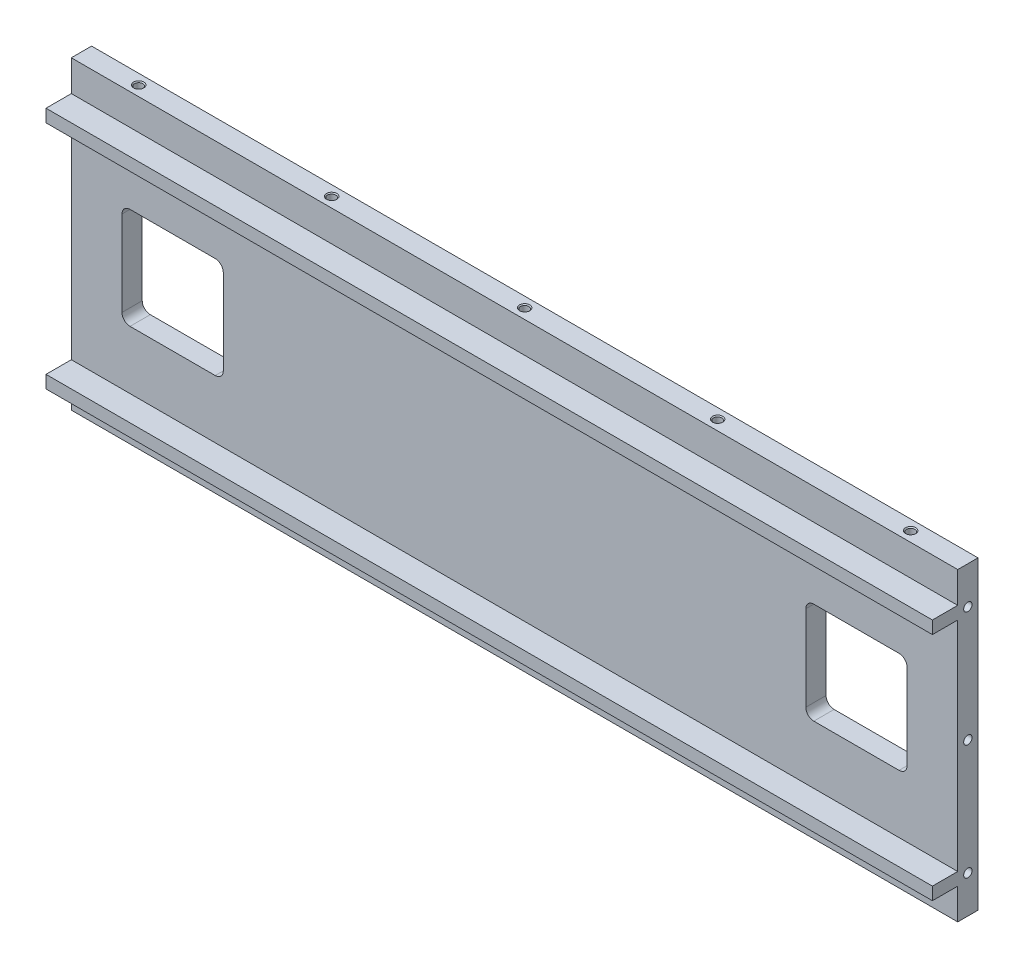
ISO-10303-21;
HEADER;
FILE_DESCRIPTION(('STEP AP214'),'2;1');
FILE_NAME('part.step','',(''),(''),'','','');
FILE_SCHEMA(('AUTOMOTIVE_DESIGN { 1 0 10303 214 1 1 1 1 }'));
ENDSEC;
DATA;
#1=APPLICATION_CONTEXT('core data for automotive mechanical design processes');
#2=APPLICATION_PROTOCOL_DEFINITION('international standard','automotive_design',2000,#1);
#3=PRODUCT_CONTEXT('',#1,'mechanical');
#4=PRODUCT('Part','Part','',(#3));
#5=PRODUCT_RELATED_PRODUCT_CATEGORY('part','',(#4));
#6=PRODUCT_DEFINITION_FORMATION('','',#4);
#7=PRODUCT_DEFINITION_CONTEXT('part definition',#1,'design');
#8=PRODUCT_DEFINITION('design','',#6,#7);
#9=PRODUCT_DEFINITION_SHAPE('','',#8);
#10=(LENGTH_UNIT() NAMED_UNIT(*) SI_UNIT(.MILLI.,.METRE.));
#11=(NAMED_UNIT(*) PLANE_ANGLE_UNIT() SI_UNIT($,.RADIAN.));
#12=(NAMED_UNIT(*) SI_UNIT($,.STERADIAN.) SOLID_ANGLE_UNIT());
#13=UNCERTAINTY_MEASURE_WITH_UNIT(LENGTH_MEASURE(1.E-05),#10,'distance_accuracy_value','');
#14=(GEOMETRIC_REPRESENTATION_CONTEXT(3) GLOBAL_UNCERTAINTY_ASSIGNED_CONTEXT((#13)) GLOBAL_UNIT_ASSIGNED_CONTEXT((#10,
#11,#12)) REPRESENTATION_CONTEXT('',''));
#15=CARTESIAN_POINT('',(0.,0.,0.));
#16=DIRECTION('',(0.,0.,1.));
#17=DIRECTION('',(1.,0.,0.));
#18=AXIS2_PLACEMENT_3D('',#15,#16,#17);
#19=CARTESIAN_POINT('',(-175.,60.25,8.));
#20=DIRECTION('',(1.,0.,0.));
#21=DIRECTION('',(0.,0.,-1.));
#22=AXIS2_PLACEMENT_3D('',#19,#20,#21);
#23=PLANE('',#22);
#24=CARTESIAN_POINT('',(-175.,-45.5,4.));
#25=DIRECTION('',(-1.,0.,0.));
#26=DIRECTION('',(0.,0.,1.));
#27=AXIS2_PLACEMENT_3D('',#24,#25,#26);
#28=CIRCLE('',#27,1.64999999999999);
#29=CARTESIAN_POINT('',(-175.,-45.5,5.64999999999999));
#30=VERTEX_POINT('',#29);
#31=EDGE_CURVE('E279',#30,#30,#28,.T.);
#32=ORIENTED_EDGE('',*,*,#31,.F.);
#33=EDGE_LOOP('',(#32));
#34=FACE_BOUND('',#33,.T.);
#35=CARTESIAN_POINT('',(-175.,0.,4.));
#36=DIRECTION('',(-1.,0.,0.));
#37=DIRECTION('',(0.,0.,1.));
#38=AXIS2_PLACEMENT_3D('',#35,#36,#37);
#39=CIRCLE('',#38,1.64999999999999);
#40=CARTESIAN_POINT('',(-175.,0.,5.64999999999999));
#41=VERTEX_POINT('',#40);
#42=EDGE_CURVE('E290',#41,#41,#39,.T.);
#43=ORIENTED_EDGE('',*,*,#42,.F.);
#44=EDGE_LOOP('',(#43));
#45=FACE_BOUND('',#44,.T.);
#46=DIRECTION('',(0.,-1.,0.));
#47=VECTOR('',#46,1.);
#48=CARTESIAN_POINT('',(-175.,60.25,0.));
#49=LINE('',#48,#47);
#50=CARTESIAN_POINT('',(-175.,60.25,0.));
#51=VERTEX_POINT('',#50);
#52=CARTESIAN_POINT('',(-175.,-60.25,0.));
#53=VERTEX_POINT('',#52);
#54=EDGE_CURVE('E556',#51,#53,#49,.T.);
#55=ORIENTED_EDGE('',*,*,#54,.T.);
#56=DIRECTION('',(0.,0.,-1.));
#57=VECTOR('',#56,1.);
#58=CARTESIAN_POINT('',(-175.,-60.25,8.));
#59=LINE('',#58,#57);
#60=CARTESIAN_POINT('',(-175.,-60.25,8.));
#61=VERTEX_POINT('',#60);
#62=EDGE_CURVE('E586',#61,#53,#59,.T.);
#63=ORIENTED_EDGE('',*,*,#62,.F.);
#64=DIRECTION('',(0.,-1.,0.));
#65=VECTOR('',#64,1.);
#66=CARTESIAN_POINT('',(-175.,60.25,8.));
#67=LINE('',#66,#65);
#68=CARTESIAN_POINT('',(-175.,-48.,8.));
#69=VERTEX_POINT('',#68);
#70=EDGE_CURVE('E561',#69,#61,#67,.T.);
#71=ORIENTED_EDGE('',*,*,#70,.F.);
#72=DIRECTION('',(0.,0.,-1.));
#73=VECTOR('',#72,1.);
#74=CARTESIAN_POINT('',(-175.,-48.,18.));
#75=LINE('',#74,#73);
#76=CARTESIAN_POINT('',(-175.,-48.,18.));
#77=VERTEX_POINT('',#76);
#78=EDGE_CURVE('E445',#77,#69,#75,.T.);
#79=ORIENTED_EDGE('',*,*,#78,.F.);
#80=DIRECTION('',(0.,1.,0.));
#81=VECTOR('',#80,1.);
#82=CARTESIAN_POINT('',(-175.,-48.,18.));
#83=LINE('',#82,#81);
#84=CARTESIAN_POINT('',(-175.,-43.,18.));
#85=VERTEX_POINT('',#84);
#86=EDGE_CURVE('E421',#77,#85,#83,.T.);
#87=ORIENTED_EDGE('',*,*,#86,.T.);
#88=DIRECTION('',(0.,0.,-1.));
#89=VECTOR('',#88,1.);
#90=CARTESIAN_POINT('',(-175.,-43.,18.));
#91=LINE('',#90,#89);
#92=CARTESIAN_POINT('',(-175.,-43.,8.));
#93=VERTEX_POINT('',#92);
#94=EDGE_CURVE('E434',#85,#93,#91,.T.);
#95=ORIENTED_EDGE('',*,*,#94,.T.);
#96=CARTESIAN_POINT('',(-175.,43.,8.));
#97=VERTEX_POINT('',#96);
#98=EDGE_CURVE('E560',#97,#93,#67,.T.);
#99=ORIENTED_EDGE('',*,*,#98,.F.);
#100=DIRECTION('',(0.,0.,-1.));
#101=VECTOR('',#100,1.);
#102=CARTESIAN_POINT('',(-175.,43.,18.));
#103=LINE('',#102,#101);
#104=CARTESIAN_POINT('',(-175.,43.,18.));
#105=VERTEX_POINT('',#104);
#106=EDGE_CURVE('E553',#105,#97,#103,.T.);
#107=ORIENTED_EDGE('',*,*,#106,.F.);
#108=DIRECTION('',(0.,-1.,0.));
#109=VECTOR('',#108,1.);
#110=CARTESIAN_POINT('',(-175.,48.,18.));
#111=LINE('',#110,#109);
#112=CARTESIAN_POINT('',(-175.,48.,18.));
#113=VERTEX_POINT('',#112);
#114=EDGE_CURVE('E530',#113,#105,#111,.T.);
#115=ORIENTED_EDGE('',*,*,#114,.F.);
#116=DIRECTION('',(0.,0.,-1.));
#117=VECTOR('',#116,1.);
#118=CARTESIAN_POINT('',(-175.,48.,18.));
#119=LINE('',#118,#117);
#120=CARTESIAN_POINT('',(-175.,48.,8.));
#121=VERTEX_POINT('',#120);
#122=EDGE_CURVE('E540',#113,#121,#119,.T.);
#123=ORIENTED_EDGE('',*,*,#122,.T.);
#124=CARTESIAN_POINT('',(-175.,60.25,8.));
#125=VERTEX_POINT('',#124);
#126=EDGE_CURVE('E557',#125,#121,#67,.T.);
#127=ORIENTED_EDGE('',*,*,#126,.F.);
#128=DIRECTION('',(0.,0.,-1.));
#129=VECTOR('',#128,1.);
#130=CARTESIAN_POINT('',(-175.,60.25,8.));
#131=LINE('',#130,#129);
#132=EDGE_CURVE('E569',#125,#51,#131,.T.);
#133=ORIENTED_EDGE('',*,*,#132,.T.);
#134=EDGE_LOOP('',(#55,#63,#71,#79,#87,#95,#99,#107,#115,#123,#127,#133));
#135=FACE_BOUND('',#134,.T.);
#136=CARTESIAN_POINT('',(-175.,45.5,4.));
#137=DIRECTION('',(-1.,0.,0.));
#138=DIRECTION('',(0.,0.,1.));
#139=AXIS2_PLACEMENT_3D('',#136,#137,#138);
#140=CIRCLE('',#139,1.64999999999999);
#141=CARTESIAN_POINT('',(-175.,45.5,5.64999999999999));
#142=VERTEX_POINT('',#141);
#143=EDGE_CURVE('E280',#142,#142,#140,.T.);
#144=ORIENTED_EDGE('',*,*,#143,.F.);
#145=EDGE_LOOP('',(#144));
#146=FACE_BOUND('',#145,.T.);
#147=ADVANCED_FACE('F37',(#34,#45,#135,#146),#23,.F.);
#148=CARTESIAN_POINT('',(0.,0.,8.));
#149=DIRECTION('',(0.,0.,1.));
#150=DIRECTION('',(1.,0.,0.));
#151=AXIS2_PLACEMENT_3D('',#148,#149,#150);
#152=PLANE('',#151);
#153=DIRECTION('',(1.,0.,0.));
#154=VECTOR('',#153,1.);
#155=CARTESIAN_POINT('',(-175.,-43.,8.));
#156=LINE('',#155,#154);
#157=CARTESIAN_POINT('',(175.,-43.,8.));
#158=VERTEX_POINT('',#157);
#159=EDGE_CURVE('E425',#93,#158,#156,.T.);
#160=ORIENTED_EDGE('',*,*,#159,.T.);
#161=DIRECTION('',(0.,1.,0.));
#162=VECTOR('',#161,1.);
#163=CARTESIAN_POINT('',(175.,60.25,8.));
#164=LINE('',#163,#162);
#165=CARTESIAN_POINT('',(175.,43.,8.));
#166=VERTEX_POINT('',#165);
#167=EDGE_CURVE('E567',#158,#166,#164,.T.);
#168=ORIENTED_EDGE('',*,*,#167,.T.);
#169=DIRECTION('',(1.,0.,0.));
#170=VECTOR('',#169,1.);
#171=CARTESIAN_POINT('',(-175.,43.,8.));
#172=LINE('',#171,#170);
#173=EDGE_CURVE('E529',#97,#166,#172,.T.);
#174=ORIENTED_EDGE('',*,*,#173,.F.);
#175=ORIENTED_EDGE('',*,*,#98,.T.);
#176=EDGE_LOOP('',(#160,#168,#174,#175));
#177=FACE_BOUND('',#176,.T.);
#178=CARTESIAN_POINT('',(118.175,-16.825,8.));
#179=DIRECTION('',(0.,0.,1.));
#180=DIRECTION('',(1.,0.,0.));
#181=AXIS2_PLACEMENT_3D('',#178,#179,#180);
#182=CIRCLE('',#181,3.17499999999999);
#183=CARTESIAN_POINT('',(115.,-16.825,8.));
#184=VERTEX_POINT('',#183);
#185=CARTESIAN_POINT('',(118.175,-20.,8.));
#186=VERTEX_POINT('',#185);
#187=EDGE_CURVE('E486',#184,#186,#182,.T.);
#188=ORIENTED_EDGE('',*,*,#187,.F.);
#189=DIRECTION('',(0.,-1.,0.));
#190=VECTOR('',#189,1.);
#191=CARTESIAN_POINT('',(115.,16.825,8.));
#192=LINE('',#191,#190);
#193=CARTESIAN_POINT('',(115.,16.825,8.));
#194=VERTEX_POINT('',#193);
#195=EDGE_CURVE('E506',#194,#184,#192,.T.);
#196=ORIENTED_EDGE('',*,*,#195,.F.);
#197=CARTESIAN_POINT('',(118.175,16.825,8.));
#198=DIRECTION('',(0.,0.,1.));
#199=DIRECTION('',(1.,0.,0.));
#200=AXIS2_PLACEMENT_3D('',#197,#198,#199);
#201=CIRCLE('',#200,3.17499999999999);
#202=CARTESIAN_POINT('',(118.175,20.,8.));
#203=VERTEX_POINT('',#202);
#204=EDGE_CURVE('E503',#203,#194,#201,.T.);
#205=ORIENTED_EDGE('',*,*,#204,.F.);
#206=DIRECTION('',(-1.,0.,0.));
#207=VECTOR('',#206,1.);
#208=CARTESIAN_POINT('',(118.175,20.,8.));
#209=LINE('',#208,#207);
#210=CARTESIAN_POINT('',(151.825,20.,8.));
#211=VERTEX_POINT('',#210);
#212=EDGE_CURVE('E500',#211,#203,#209,.T.);
#213=ORIENTED_EDGE('',*,*,#212,.F.);
#214=CARTESIAN_POINT('',(151.825,16.825,8.));
#215=DIRECTION('',(0.,0.,1.));
#216=DIRECTION('',(-1.,0.,0.));
#217=AXIS2_PLACEMENT_3D('',#214,#215,#216);
#218=CIRCLE('',#217,3.17500000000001);
#219=CARTESIAN_POINT('',(155.,16.825,8.));
#220=VERTEX_POINT('',#219);
#221=EDGE_CURVE('E497',#220,#211,#218,.T.);
#222=ORIENTED_EDGE('',*,*,#221,.F.);
#223=DIRECTION('',(0.,1.,0.));
#224=VECTOR('',#223,1.);
#225=CARTESIAN_POINT('',(155.,16.825,8.));
#226=LINE('',#225,#224);
#227=CARTESIAN_POINT('',(155.,-16.825,8.));
#228=VERTEX_POINT('',#227);
#229=EDGE_CURVE('E494',#228,#220,#226,.T.);
#230=ORIENTED_EDGE('',*,*,#229,.F.);
#231=CARTESIAN_POINT('',(151.825,-16.825,8.));
#232=DIRECTION('',(0.,0.,1.));
#233=DIRECTION('',(1.,0.,0.));
#234=AXIS2_PLACEMENT_3D('',#231,#232,#233);
#235=CIRCLE('',#234,3.17500000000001);
#236=CARTESIAN_POINT('',(151.825,-20.,8.));
#237=VERTEX_POINT('',#236);
#238=EDGE_CURVE('E491',#237,#228,#235,.T.);
#239=ORIENTED_EDGE('',*,*,#238,.F.);
#240=DIRECTION('',(1.,0.,0.));
#241=VECTOR('',#240,1.);
#242=CARTESIAN_POINT('',(118.175,-20.,8.));
#243=LINE('',#242,#241);
#244=EDGE_CURVE('E488',#186,#237,#243,.T.);
#245=ORIENTED_EDGE('',*,*,#244,.F.);
#246=EDGE_LOOP('',(#188,#196,#205,#213,#222,#230,#239,#245));
#247=FACE_BOUND('',#246,.T.);
#248=DIRECTION('',(0.,-1.,0.));
#249=VECTOR('',#248,1.);
#250=CARTESIAN_POINT('',(-115.,16.825,8.));
#251=LINE('',#250,#249);
#252=CARTESIAN_POINT('',(-115.,16.825,8.));
#253=VERTEX_POINT('',#252);
#254=CARTESIAN_POINT('',(-115.,-16.825,8.));
#255=VERTEX_POINT('',#254);
#256=EDGE_CURVE('E318',#253,#255,#251,.T.);
#257=ORIENTED_EDGE('',*,*,#256,.T.);
#258=CARTESIAN_POINT('',(-118.175,-16.825,8.));
#259=DIRECTION('',(0.,0.,-1.));
#260=DIRECTION('',(-1.,0.,0.));
#261=AXIS2_PLACEMENT_3D('',#258,#259,#260);
#262=CIRCLE('',#261,3.17499999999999);
#263=CARTESIAN_POINT('',(-118.175,-20.,8.));
#264=VERTEX_POINT('',#263);
#265=EDGE_CURVE('E52',#255,#264,#262,.T.);
#266=ORIENTED_EDGE('',*,*,#265,.T.);
#267=DIRECTION('',(-1.,0.,0.));
#268=VECTOR('',#267,1.);
#269=CARTESIAN_POINT('',(-118.175,-20.,8.));
#270=LINE('',#269,#268);
#271=CARTESIAN_POINT('',(-151.825,-20.,8.));
#272=VERTEX_POINT('',#271);
#273=EDGE_CURVE('E336',#264,#272,#270,.T.);
#274=ORIENTED_EDGE('',*,*,#273,.T.);
#275=CARTESIAN_POINT('',(-151.825,-16.825,8.));
#276=DIRECTION('',(0.,0.,-1.));
#277=DIRECTION('',(-1.,0.,0.));
#278=AXIS2_PLACEMENT_3D('',#275,#276,#277);
#279=CIRCLE('',#278,3.17500000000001);
#280=CARTESIAN_POINT('',(-155.,-16.825,8.));
#281=VERTEX_POINT('',#280);
#282=EDGE_CURVE('E333',#272,#281,#279,.T.);
#283=ORIENTED_EDGE('',*,*,#282,.T.);
#284=DIRECTION('',(0.,1.,0.));
#285=VECTOR('',#284,1.);
#286=CARTESIAN_POINT('',(-155.,16.825,8.));
#287=LINE('',#286,#285);
#288=CARTESIAN_POINT('',(-155.,16.825,8.));
#289=VERTEX_POINT('',#288);
#290=EDGE_CURVE('E330',#281,#289,#287,.T.);
#291=ORIENTED_EDGE('',*,*,#290,.T.);
#292=CARTESIAN_POINT('',(-151.825,16.825,8.));
#293=DIRECTION('',(0.,0.,-1.));
#294=DIRECTION('',(1.,0.,0.));
#295=AXIS2_PLACEMENT_3D('',#292,#293,#294);
#296=CIRCLE('',#295,3.17500000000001);
#297=CARTESIAN_POINT('',(-151.825,20.,8.));
#298=VERTEX_POINT('',#297);
#299=EDGE_CURVE('E327',#289,#298,#296,.T.);
#300=ORIENTED_EDGE('',*,*,#299,.T.);
#301=DIRECTION('',(1.,0.,0.));
#302=VECTOR('',#301,1.);
#303=CARTESIAN_POINT('',(-118.175,20.,8.));
#304=LINE('',#303,#302);
#305=CARTESIAN_POINT('',(-118.175,20.,8.));
#306=VERTEX_POINT('',#305);
#307=EDGE_CURVE('E324',#298,#306,#304,.T.);
#308=ORIENTED_EDGE('',*,*,#307,.T.);
#309=CARTESIAN_POINT('',(-118.175,16.825,8.));
#310=DIRECTION('',(0.,0.,-1.));
#311=DIRECTION('',(-1.,0.,0.));
#312=AXIS2_PLACEMENT_3D('',#309,#310,#311);
#313=CIRCLE('',#312,3.17499999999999);
#314=EDGE_CURVE('E321',#306,#253,#313,.T.);
#315=ORIENTED_EDGE('',*,*,#314,.T.);
#316=EDGE_LOOP('',(#257,#266,#274,#283,#291,#300,#308,#315));
#317=FACE_BOUND('',#316,.T.);
#318=ADVANCED_FACE('F644',(#177,#247,#317),#152,.T.);
#319=CARTESIAN_POINT('',(0.,0.,0.));
#320=DIRECTION('',(0.,0.,1.));
#321=DIRECTION('',(1.,0.,0.));
#322=AXIS2_PLACEMENT_3D('',#319,#320,#321);
#323=PLANE('',#322);
#324=ORIENTED_EDGE('',*,*,#54,.F.);
#325=DIRECTION('',(-1.,0.,0.));
#326=VECTOR('',#325,1.);
#327=CARTESIAN_POINT('',(-175.,60.25,0.));
#328=LINE('',#327,#326);
#329=CARTESIAN_POINT('',(175.,60.25,0.));
#330=VERTEX_POINT('',#329);
#331=EDGE_CURVE('E576',#330,#51,#328,.T.);
#332=ORIENTED_EDGE('',*,*,#331,.F.);
#333=DIRECTION('',(0.,1.,0.));
#334=VECTOR('',#333,1.);
#335=CARTESIAN_POINT('',(175.,60.25,0.));
#336=LINE('',#335,#334);
#337=CARTESIAN_POINT('',(175.,-60.25,0.));
#338=VERTEX_POINT('',#337);
#339=EDGE_CURVE('E574',#338,#330,#336,.T.);
#340=ORIENTED_EDGE('',*,*,#339,.F.);
#341=DIRECTION('',(1.,0.,0.));
#342=VECTOR('',#341,1.);
#343=CARTESIAN_POINT('',(-175.,-60.25,0.));
#344=LINE('',#343,#342);
#345=EDGE_CURVE('E572',#53,#338,#344,.T.);
#346=ORIENTED_EDGE('',*,*,#345,.F.);
#347=EDGE_LOOP('',(#324,#332,#340,#346));
#348=FACE_BOUND('',#347,.T.);
#349=DIRECTION('',(0.,1.,0.));
#350=VECTOR('',#349,1.);
#351=CARTESIAN_POINT('',(115.,16.825,0.));
#352=LINE('',#351,#350);
#353=CARTESIAN_POINT('',(115.,-16.825,0.));
#354=VERTEX_POINT('',#353);
#355=CARTESIAN_POINT('',(115.,16.825,0.));
#356=VERTEX_POINT('',#355);
#357=EDGE_CURVE('E480',#354,#356,#352,.T.);
#358=ORIENTED_EDGE('',*,*,#357,.F.);
#359=CARTESIAN_POINT('',(118.175,-16.825,0.));
#360=DIRECTION('',(0.,0.,1.));
#361=DIRECTION('',(1.,0.,0.));
#362=AXIS2_PLACEMENT_3D('',#359,#360,#361);
#363=CIRCLE('',#362,3.17499999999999);
#364=CARTESIAN_POINT('',(118.175,-20.,0.));
#365=VERTEX_POINT('',#364);
#366=EDGE_CURVE('E483',#365,#354,#363,.F.);
#367=ORIENTED_EDGE('',*,*,#366,.F.);
#368=DIRECTION('',(-1.,0.,0.));
#369=VECTOR('',#368,1.);
#370=CARTESIAN_POINT('',(118.175,-20.,0.));
#371=LINE('',#370,#369);
#372=CARTESIAN_POINT('',(151.825,-20.,0.));
#373=VERTEX_POINT('',#372);
#374=EDGE_CURVE('E512',#373,#365,#371,.T.);
#375=ORIENTED_EDGE('',*,*,#374,.F.);
#376=CARTESIAN_POINT('',(151.825,-16.825,0.));
#377=DIRECTION('',(0.,0.,1.));
#378=DIRECTION('',(1.,0.,0.));
#379=AXIS2_PLACEMENT_3D('',#376,#377,#378);
#380=CIRCLE('',#379,3.17500000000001);
#381=CARTESIAN_POINT('',(155.,-16.825,0.));
#382=VERTEX_POINT('',#381);
#383=EDGE_CURVE('E466',#382,#373,#380,.F.);
#384=ORIENTED_EDGE('',*,*,#383,.F.);
#385=DIRECTION('',(0.,-1.,0.));
#386=VECTOR('',#385,1.);
#387=CARTESIAN_POINT('',(155.,16.825,0.));
#388=LINE('',#387,#386);
#389=CARTESIAN_POINT('',(155.,16.825,0.));
#390=VERTEX_POINT('',#389);
#391=EDGE_CURVE('E468',#390,#382,#388,.T.);
#392=ORIENTED_EDGE('',*,*,#391,.F.);
#393=CARTESIAN_POINT('',(151.825,16.825,0.));
#394=DIRECTION('',(0.,0.,1.));
#395=DIRECTION('',(1.,0.,0.));
#396=AXIS2_PLACEMENT_3D('',#393,#394,#395);
#397=CIRCLE('',#396,3.17500000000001);
#398=CARTESIAN_POINT('',(151.825,20.,0.));
#399=VERTEX_POINT('',#398);
#400=EDGE_CURVE('E471',#399,#390,#397,.F.);
#401=ORIENTED_EDGE('',*,*,#400,.F.);
#402=DIRECTION('',(1.,0.,0.));
#403=VECTOR('',#402,1.);
#404=CARTESIAN_POINT('',(118.175,20.,0.));
#405=LINE('',#404,#403);
#406=CARTESIAN_POINT('',(118.175,20.,0.));
#407=VERTEX_POINT('',#406);
#408=EDGE_CURVE('E474',#407,#399,#405,.T.);
#409=ORIENTED_EDGE('',*,*,#408,.F.);
#410=CARTESIAN_POINT('',(118.175,16.825,0.));
#411=DIRECTION('',(0.,0.,1.));
#412=DIRECTION('',(1.,0.,0.));
#413=AXIS2_PLACEMENT_3D('',#410,#411,#412);
#414=CIRCLE('',#413,3.17499999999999);
#415=EDGE_CURVE('E477',#356,#407,#414,.F.);
#416=ORIENTED_EDGE('',*,*,#415,.F.);
#417=EDGE_LOOP('',(#358,#367,#375,#384,#392,#401,#409,#416));
#418=FACE_BOUND('',#417,.T.);
#419=CARTESIAN_POINT('',(-118.175,-16.825,0.));
#420=DIRECTION('',(0.,0.,1.));
#421=DIRECTION('',(1.,0.,0.));
#422=AXIS2_PLACEMENT_3D('',#419,#420,#421);
#423=CIRCLE('',#422,3.17499999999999);
#424=CARTESIAN_POINT('',(-118.175,-20.,0.));
#425=VERTEX_POINT('',#424);
#426=CARTESIAN_POINT('',(-115.,-16.825,0.));
#427=VERTEX_POINT('',#426);
#428=EDGE_CURVE('E314',#425,#427,#423,.T.);
#429=ORIENTED_EDGE('',*,*,#428,.T.);
#430=DIRECTION('',(0.,1.,0.));
#431=VECTOR('',#430,1.);
#432=CARTESIAN_POINT('',(-115.,16.825,0.));
#433=LINE('',#432,#431);
#434=CARTESIAN_POINT('',(-115.,16.825,0.));
#435=VERTEX_POINT('',#434);
#436=EDGE_CURVE('E342',#427,#435,#433,.T.);
#437=ORIENTED_EDGE('',*,*,#436,.T.);
#438=CARTESIAN_POINT('',(-118.175,16.825,0.));
#439=DIRECTION('',(0.,0.,1.));
#440=DIRECTION('',(1.,0.,0.));
#441=AXIS2_PLACEMENT_3D('',#438,#439,#440);
#442=CIRCLE('',#441,3.17499999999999);
#443=CARTESIAN_POINT('',(-118.175,20.,0.));
#444=VERTEX_POINT('',#443);
#445=EDGE_CURVE('E296',#435,#444,#442,.T.);
#446=ORIENTED_EDGE('',*,*,#445,.T.);
#447=DIRECTION('',(-1.,0.,0.));
#448=VECTOR('',#447,1.);
#449=CARTESIAN_POINT('',(-118.175,20.,0.));
#450=LINE('',#449,#448);
#451=CARTESIAN_POINT('',(-151.825,20.,0.));
#452=VERTEX_POINT('',#451);
#453=EDGE_CURVE('E299',#444,#452,#450,.T.);
#454=ORIENTED_EDGE('',*,*,#453,.T.);
#455=CARTESIAN_POINT('',(-151.825,16.825,0.));
#456=DIRECTION('',(0.,0.,1.));
#457=DIRECTION('',(1.,0.,0.));
#458=AXIS2_PLACEMENT_3D('',#455,#456,#457);
#459=CIRCLE('',#458,3.17500000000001);
#460=CARTESIAN_POINT('',(-155.,16.825,0.));
#461=VERTEX_POINT('',#460);
#462=EDGE_CURVE('E302',#452,#461,#459,.T.);
#463=ORIENTED_EDGE('',*,*,#462,.T.);
#464=DIRECTION('',(0.,-1.,0.));
#465=VECTOR('',#464,1.);
#466=CARTESIAN_POINT('',(-155.,16.825,0.));
#467=LINE('',#466,#465);
#468=CARTESIAN_POINT('',(-155.,-16.825,0.));
#469=VERTEX_POINT('',#468);
#470=EDGE_CURVE('E305',#461,#469,#467,.T.);
#471=ORIENTED_EDGE('',*,*,#470,.T.);
#472=CARTESIAN_POINT('',(-151.825,-16.825,0.));
#473=DIRECTION('',(0.,0.,1.));
#474=DIRECTION('',(1.,0.,0.));
#475=AXIS2_PLACEMENT_3D('',#472,#473,#474);
#476=CIRCLE('',#475,3.17500000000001);
#477=CARTESIAN_POINT('',(-151.825,-20.,0.));
#478=VERTEX_POINT('',#477);
#479=EDGE_CURVE('E308',#469,#478,#476,.T.);
#480=ORIENTED_EDGE('',*,*,#479,.T.);
#481=DIRECTION('',(1.,0.,0.));
#482=VECTOR('',#481,1.);
#483=CARTESIAN_POINT('',(-118.175,-20.,0.));
#484=LINE('',#483,#482);
#485=EDGE_CURVE('E311',#478,#425,#484,.T.);
#486=ORIENTED_EDGE('',*,*,#485,.T.);
#487=EDGE_LOOP('',(#429,#437,#446,#454,#463,#471,#480,#486));
#488=FACE_BOUND('',#487,.T.);
#489=ADVANCED_FACE('F650',(#348,#418,#488),#323,.F.);
#490=DIRECTION('',(-1.,0.,0.));
#491=VECTOR('',#490,1.);
#492=CARTESIAN_POINT('',(-175.,-48.,8.));
#493=LINE('',#492,#491);
#494=CARTESIAN_POINT('',(175.,-48.,8.));
#495=VERTEX_POINT('',#494);
#496=EDGE_CURVE('E420',#495,#69,#493,.T.);
#497=ORIENTED_EDGE('',*,*,#496,.T.);
#498=ORIENTED_EDGE('',*,*,#70,.T.);
#499=DIRECTION('',(1.,0.,0.));
#500=VECTOR('',#499,1.);
#501=CARTESIAN_POINT('',(-175.,-60.25,8.));
#502=LINE('',#501,#500);
#503=CARTESIAN_POINT('',(175.,-60.25,8.));
#504=VERTEX_POINT('',#503);
#505=EDGE_CURVE('E559',#61,#504,#502,.T.);
#506=ORIENTED_EDGE('',*,*,#505,.T.);
#507=EDGE_CURVE('E564',#504,#495,#164,.T.);
#508=ORIENTED_EDGE('',*,*,#507,.T.);
#509=EDGE_LOOP('',(#497,#498,#506,#508));
#510=FACE_BOUND('',#509,.T.);
#511=ADVANCED_FACE('F653',(#510),#152,.T.);
#512=DIRECTION('',(-1.,0.,0.));
#513=VECTOR('',#512,1.);
#514=CARTESIAN_POINT('',(-175.,48.,8.));
#515=LINE('',#514,#513);
#516=CARTESIAN_POINT('',(175.,48.,8.));
#517=VERTEX_POINT('',#516);
#518=EDGE_CURVE('E534',#517,#121,#515,.T.);
#519=ORIENTED_EDGE('',*,*,#518,.F.);
#520=CARTESIAN_POINT('',(175.,60.25,8.));
#521=VERTEX_POINT('',#520);
#522=EDGE_CURVE('E563',#517,#521,#164,.T.);
#523=ORIENTED_EDGE('',*,*,#522,.T.);
#524=DIRECTION('',(-1.,0.,0.));
#525=VECTOR('',#524,1.);
#526=CARTESIAN_POINT('',(-175.,60.25,8.));
#527=LINE('',#526,#525);
#528=EDGE_CURVE('E566',#521,#125,#527,.T.);
#529=ORIENTED_EDGE('',*,*,#528,.T.);
#530=ORIENTED_EDGE('',*,*,#126,.T.);
#531=EDGE_LOOP('',(#519,#523,#529,#530));
#532=FACE_BOUND('',#531,.T.);
#533=ADVANCED_FACE('F654',(#532),#152,.T.);
#534=CARTESIAN_POINT('',(-175.,-60.25,8.));
#535=DIRECTION('',(0.,1.,0.));
#536=DIRECTION('',(0.,0.,1.));
#537=AXIS2_PLACEMENT_3D('',#534,#535,#536);
#538=PLANE('',#537);
#539=CARTESIAN_POINT('',(-152.4,-60.25,4.));
#540=DIRECTION('',(0.,-1.,0.));
#541=DIRECTION('',(0.,0.,-1.));
#542=AXIS2_PLACEMENT_3D('',#539,#540,#541);
#543=CIRCLE('',#542,2.025);
#544=CARTESIAN_POINT('',(-152.4,-60.25,1.975));
#545=VERTEX_POINT('',#544);
#546=EDGE_CURVE('E375',#545,#545,#543,.T.);
#547=ORIENTED_EDGE('',*,*,#546,.F.);
#548=EDGE_LOOP('',(#547));
#549=FACE_BOUND('',#548,.T.);
#550=CARTESIAN_POINT('',(-76.2,-60.25,4.));
#551=DIRECTION('',(0.,-1.,0.));
#552=DIRECTION('',(0.,0.,-1.));
#553=AXIS2_PLACEMENT_3D('',#550,#551,#552);
#554=CIRCLE('',#553,2.025);
#555=CARTESIAN_POINT('',(-76.2,-60.25,1.975));
#556=VERTEX_POINT('',#555);
#557=EDGE_CURVE('E384',#556,#556,#554,.T.);
#558=ORIENTED_EDGE('',*,*,#557,.F.);
#559=EDGE_LOOP('',(#558));
#560=FACE_BOUND('',#559,.T.);
#561=CARTESIAN_POINT('',(0.,-60.25,4.));
#562=DIRECTION('',(0.,-1.,0.));
#563=DIRECTION('',(0.,0.,-1.));
#564=AXIS2_PLACEMENT_3D('',#561,#562,#563);
#565=CIRCLE('',#564,2.025);
#566=CARTESIAN_POINT('',(0.,-60.25,1.975));
#567=VERTEX_POINT('',#566);
#568=EDGE_CURVE('E393',#567,#567,#565,.T.);
#569=ORIENTED_EDGE('',*,*,#568,.F.);
#570=EDGE_LOOP('',(#569));
#571=FACE_BOUND('',#570,.T.);
#572=CARTESIAN_POINT('',(76.2,-60.25,4.));
#573=DIRECTION('',(0.,-1.,0.));
#574=DIRECTION('',(0.,0.,-1.));
#575=AXIS2_PLACEMENT_3D('',#572,#573,#574);
#576=CIRCLE('',#575,2.025);
#577=CARTESIAN_POINT('',(76.2,-60.25,1.975));
#578=VERTEX_POINT('',#577);
#579=EDGE_CURVE('E402',#578,#578,#576,.T.);
#580=ORIENTED_EDGE('',*,*,#579,.F.);
#581=EDGE_LOOP('',(#580));
#582=FACE_BOUND('',#581,.T.);
#583=CARTESIAN_POINT('',(152.4,-60.25,4.));
#584=DIRECTION('',(0.,-1.,0.));
#585=DIRECTION('',(0.,0.,-1.));
#586=AXIS2_PLACEMENT_3D('',#583,#584,#585);
#587=CIRCLE('',#586,2.025);
#588=CARTESIAN_POINT('',(152.4,-60.25,1.975));
#589=VERTEX_POINT('',#588);
#590=EDGE_CURVE('E411',#589,#589,#587,.T.);
#591=ORIENTED_EDGE('',*,*,#590,.F.);
#592=EDGE_LOOP('',(#591));
#593=FACE_BOUND('',#592,.T.);
#594=ORIENTED_EDGE('',*,*,#345,.T.);
#595=DIRECTION('',(0.,0.,-1.));
#596=VECTOR('',#595,1.);
#597=CARTESIAN_POINT('',(175.,-60.25,8.));
#598=LINE('',#597,#596);
#599=EDGE_CURVE('E583',#504,#338,#598,.T.);
#600=ORIENTED_EDGE('',*,*,#599,.F.);
#601=ORIENTED_EDGE('',*,*,#505,.F.);
#602=ORIENTED_EDGE('',*,*,#62,.T.);
#603=EDGE_LOOP('',(#594,#600,#601,#602));
#604=FACE_BOUND('',#603,.T.);
#605=ADVANCED_FACE('F637',(#549,#560,#571,#582,#593,#604),#538,.F.);
#606=CARTESIAN_POINT('',(175.,60.25,8.));
#607=DIRECTION('',(-1.,0.,0.));
#608=DIRECTION('',(0.,0.,1.));
#609=AXIS2_PLACEMENT_3D('',#606,#607,#608);
#610=PLANE('',#609);
#611=CARTESIAN_POINT('',(175.,45.5,4.));
#612=DIRECTION('',(1.,0.,0.));
#613=DIRECTION('',(0.,0.,-1.));
#614=AXIS2_PLACEMENT_3D('',#611,#612,#613);
#615=CIRCLE('',#614,1.64999999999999);
#616=CARTESIAN_POINT('',(175.,45.5,2.35000000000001));
#617=VERTEX_POINT('',#616);
#618=EDGE_CURVE('E357',#617,#617,#615,.T.);
#619=ORIENTED_EDGE('',*,*,#618,.F.);
#620=EDGE_LOOP('',(#619));
#621=FACE_BOUND('',#620,.T.);
#622=CARTESIAN_POINT('',(175.,-45.5,4.));
#623=DIRECTION('',(1.,0.,0.));
#624=DIRECTION('',(0.,0.,-1.));
#625=AXIS2_PLACEMENT_3D('',#622,#623,#624);
#626=CIRCLE('',#625,1.64999999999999);
#627=CARTESIAN_POINT('',(175.,-45.5,2.35000000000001));
#628=VERTEX_POINT('',#627);
#629=EDGE_CURVE('E363',#628,#628,#626,.T.);
#630=ORIENTED_EDGE('',*,*,#629,.F.);
#631=EDGE_LOOP('',(#630));
#632=FACE_BOUND('',#631,.T.);
#633=CARTESIAN_POINT('',(175.,0.,4.));
#634=DIRECTION('',(1.,0.,0.));
#635=DIRECTION('',(0.,0.,-1.));
#636=AXIS2_PLACEMENT_3D('',#633,#634,#635);
#637=CIRCLE('',#636,1.64999999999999);
#638=CARTESIAN_POINT('',(175.,0.,2.35000000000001));
#639=VERTEX_POINT('',#638);
#640=EDGE_CURVE('E369',#639,#639,#637,.T.);
#641=ORIENTED_EDGE('',*,*,#640,.F.);
#642=EDGE_LOOP('',(#641));
#643=FACE_BOUND('',#642,.T.);
#644=ORIENTED_EDGE('',*,*,#339,.T.);
#645=DIRECTION('',(0.,0.,-1.));
#646=VECTOR('',#645,1.);
#647=CARTESIAN_POINT('',(175.,60.25,8.));
#648=LINE('',#647,#646);
#649=EDGE_CURVE('E580',#521,#330,#648,.T.);
#650=ORIENTED_EDGE('',*,*,#649,.F.);
#651=ORIENTED_EDGE('',*,*,#522,.F.);
#652=DIRECTION('',(0.,0.,-1.));
#653=VECTOR('',#652,1.);
#654=CARTESIAN_POINT('',(175.,48.,18.));
#655=LINE('',#654,#653);
#656=CARTESIAN_POINT('',(175.,48.,18.));
#657=VERTEX_POINT('',#656);
#658=EDGE_CURVE('E547',#657,#517,#655,.T.);
#659=ORIENTED_EDGE('',*,*,#658,.F.);
#660=DIRECTION('',(0.,1.,0.));
#661=VECTOR('',#660,1.);
#662=CARTESIAN_POINT('',(175.,48.,18.));
#663=LINE('',#662,#661);
#664=CARTESIAN_POINT('',(175.,43.,18.));
#665=VERTEX_POINT('',#664);
#666=EDGE_CURVE('E536',#665,#657,#663,.T.);
#667=ORIENTED_EDGE('',*,*,#666,.F.);
#668=DIRECTION('',(0.,0.,-1.));
#669=VECTOR('',#668,1.);
#670=CARTESIAN_POINT('',(175.,43.,18.));
#671=LINE('',#670,#669);
#672=EDGE_CURVE('E550',#665,#166,#671,.T.);
#673=ORIENTED_EDGE('',*,*,#672,.T.);
#674=ORIENTED_EDGE('',*,*,#167,.F.);
#675=DIRECTION('',(0.,0.,-1.));
#676=VECTOR('',#675,1.);
#677=CARTESIAN_POINT('',(175.,-43.,18.));
#678=LINE('',#677,#676);
#679=CARTESIAN_POINT('',(175.,-43.,18.));
#680=VERTEX_POINT('',#679);
#681=EDGE_CURVE('E439',#680,#158,#678,.T.);
#682=ORIENTED_EDGE('',*,*,#681,.F.);
#683=DIRECTION('',(0.,-1.,0.));
#684=VECTOR('',#683,1.);
#685=CARTESIAN_POINT('',(175.,-48.,18.));
#686=LINE('',#685,#684);
#687=CARTESIAN_POINT('',(175.,-48.,18.));
#688=VERTEX_POINT('',#687);
#689=EDGE_CURVE('E428',#680,#688,#686,.T.);
#690=ORIENTED_EDGE('',*,*,#689,.T.);
#691=DIRECTION('',(0.,0.,-1.));
#692=VECTOR('',#691,1.);
#693=CARTESIAN_POINT('',(175.,-48.,18.));
#694=LINE('',#693,#692);
#695=EDGE_CURVE('E442',#688,#495,#694,.T.);
#696=ORIENTED_EDGE('',*,*,#695,.T.);
#697=ORIENTED_EDGE('',*,*,#507,.F.);
#698=ORIENTED_EDGE('',*,*,#599,.T.);
#699=EDGE_LOOP('',(#644,#650,#651,#659,#667,#673,#674,#682,#690,#696,#697,#698));
#700=FACE_BOUND('',#699,.T.);
#701=ADVANCED_FACE('F627',(#621,#632,#643,#700),#610,.F.);
#702=CARTESIAN_POINT('',(-175.,60.25,8.));
#703=DIRECTION('',(0.,-1.,0.));
#704=DIRECTION('',(0.,0.,-1.));
#705=AXIS2_PLACEMENT_3D('',#702,#703,#704);
#706=PLANE('',#705);
#707=CARTESIAN_POINT('',(76.2,60.25,4.));
#708=DIRECTION('',(0.,1.,0.));
#709=DIRECTION('',(0.,0.,1.));
#710=AXIS2_PLACEMENT_3D('',#707,#708,#709);
#711=CIRCLE('',#710,2.025);
#712=CARTESIAN_POINT('',(76.2,60.25,6.025));
#713=VERTEX_POINT('',#712);
#714=EDGE_CURVE('E448',#713,#713,#711,.T.);
#715=ORIENTED_EDGE('',*,*,#714,.F.);
#716=EDGE_LOOP('',(#715));
#717=FACE_BOUND('',#716,.T.);
#718=CARTESIAN_POINT('',(152.4,60.25,4.));
#719=DIRECTION('',(0.,1.,0.));
#720=DIRECTION('',(0.,0.,1.));
#721=AXIS2_PLACEMENT_3D('',#718,#719,#720);
#722=CIRCLE('',#721,2.025);
#723=CARTESIAN_POINT('',(152.4,60.25,6.025));
#724=VERTEX_POINT('',#723);
#725=EDGE_CURVE('E457',#724,#724,#722,.T.);
#726=ORIENTED_EDGE('',*,*,#725,.F.);
#727=EDGE_LOOP('',(#726));
#728=FACE_BOUND('',#727,.T.);
#729=ORIENTED_EDGE('',*,*,#331,.T.);
#730=ORIENTED_EDGE('',*,*,#132,.F.);
#731=ORIENTED_EDGE('',*,*,#528,.F.);
#732=ORIENTED_EDGE('',*,*,#649,.T.);
#733=EDGE_LOOP('',(#729,#730,#731,#732));
#734=FACE_BOUND('',#733,.T.);
#735=CARTESIAN_POINT('',(0.,60.25,4.));
#736=DIRECTION('',(0.,1.,0.));
#737=DIRECTION('',(0.,0.,1.));
#738=AXIS2_PLACEMENT_3D('',#735,#736,#737);
#739=CIRCLE('',#738,2.025);
#740=CARTESIAN_POINT('',(0.,60.25,6.025));
#741=VERTEX_POINT('',#740);
#742=EDGE_CURVE('E589',#741,#741,#739,.T.);
#743=ORIENTED_EDGE('',*,*,#742,.F.);
#744=EDGE_LOOP('',(#743));
#745=FACE_BOUND('',#744,.T.);
#746=CARTESIAN_POINT('',(-76.2000000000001,60.25,4.));
#747=DIRECTION('',(0.,1.,0.));
#748=DIRECTION('',(0.,0.,1.));
#749=AXIS2_PLACEMENT_3D('',#746,#747,#748);
#750=CIRCLE('',#749,2.025);
#751=CARTESIAN_POINT('',(-76.2000000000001,60.25,6.025));
#752=VERTEX_POINT('',#751);
#753=EDGE_CURVE('E598',#752,#752,#750,.T.);
#754=ORIENTED_EDGE('',*,*,#753,.F.);
#755=EDGE_LOOP('',(#754));
#756=FACE_BOUND('',#755,.T.);
#757=CARTESIAN_POINT('',(-152.4,60.25,4.));
#758=DIRECTION('',(0.,1.,0.));
#759=DIRECTION('',(0.,0.,1.));
#760=AXIS2_PLACEMENT_3D('',#757,#758,#759);
#761=CIRCLE('',#760,2.025);
#762=CARTESIAN_POINT('',(-152.4,60.25,6.025));
#763=VERTEX_POINT('',#762);
#764=EDGE_CURVE('E607',#763,#763,#761,.T.);
#765=ORIENTED_EDGE('',*,*,#764,.F.);
#766=EDGE_LOOP('',(#765));
#767=FACE_BOUND('',#766,.T.);
#768=ADVANCED_FACE('F624',(#717,#728,#734,#745,#756,#767),#706,.F.);
#769=CARTESIAN_POINT('',(-175.,43.,18.));
#770=DIRECTION('',(0.,1.,0.));
#771=DIRECTION('',(-1.,0.,0.));
#772=AXIS2_PLACEMENT_3D('',#769,#770,#771);
#773=PLANE('',#772);
#774=ORIENTED_EDGE('',*,*,#173,.T.);
#775=ORIENTED_EDGE('',*,*,#672,.F.);
#776=DIRECTION('',(1.,0.,0.));
#777=VECTOR('',#776,1.);
#778=CARTESIAN_POINT('',(-175.,43.,18.));
#779=LINE('',#778,#777);
#780=EDGE_CURVE('E533',#105,#665,#779,.T.);
#781=ORIENTED_EDGE('',*,*,#780,.F.);
#782=ORIENTED_EDGE('',*,*,#106,.T.);
#783=EDGE_LOOP('',(#774,#775,#781,#782));
#784=FACE_BOUND('',#783,.T.);
#785=ADVANCED_FACE('F626',(#784),#773,.F.);
#786=CARTESIAN_POINT('',(-175.,48.,18.));
#787=DIRECTION('',(0.,-1.,0.));
#788=DIRECTION('',(0.,0.,-1.));
#789=AXIS2_PLACEMENT_3D('',#786,#787,#788);
#790=PLANE('',#789);
#791=ORIENTED_EDGE('',*,*,#518,.T.);
#792=ORIENTED_EDGE('',*,*,#122,.F.);
#793=DIRECTION('',(-1.,0.,0.));
#794=VECTOR('',#793,1.);
#795=CARTESIAN_POINT('',(-175.,48.,18.));
#796=LINE('',#795,#794);
#797=EDGE_CURVE('E538',#657,#113,#796,.T.);
#798=ORIENTED_EDGE('',*,*,#797,.F.);
#799=ORIENTED_EDGE('',*,*,#658,.T.);
#800=EDGE_LOOP('',(#791,#792,#798,#799));
#801=FACE_BOUND('',#800,.T.);
#802=ADVANCED_FACE('F634',(#801),#790,.F.);
#803=CARTESIAN_POINT('',(0.,0.,18.));
#804=DIRECTION('',(0.,0.,1.));
#805=DIRECTION('',(1.,0.,0.));
#806=AXIS2_PLACEMENT_3D('',#803,#804,#805);
#807=PLANE('',#806);
#808=ORIENTED_EDGE('',*,*,#114,.T.);
#809=ORIENTED_EDGE('',*,*,#780,.T.);
#810=ORIENTED_EDGE('',*,*,#666,.T.);
#811=ORIENTED_EDGE('',*,*,#797,.T.);
#812=EDGE_LOOP('',(#808,#809,#810,#811));
#813=FACE_BOUND('',#812,.T.);
#814=ADVANCED_FACE('F755',(#813),#807,.T.);
#815=CARTESIAN_POINT('',(118.175,-16.825,-0.000999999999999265));
#816=DIRECTION('',(0.,0.,1.));
#817=DIRECTION('',(1.,0.,0.));
#818=AXIS2_PLACEMENT_3D('',#815,#816,#817);
#819=CYLINDRICAL_SURFACE('',#818,3.17499999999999);
#820=ORIENTED_EDGE('',*,*,#366,.T.);
#821=DIRECTION('',(0.,0.,1.));
#822=VECTOR('',#821,1.);
#823=CARTESIAN_POINT('',(115.,-16.825,-0.000999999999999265));
#824=LINE('',#823,#822);
#825=EDGE_CURVE('E510',#354,#184,#824,.T.);
#826=ORIENTED_EDGE('',*,*,#825,.T.);
#827=ORIENTED_EDGE('',*,*,#187,.T.);
#828=DIRECTION('',(0.,0.,1.));
#829=VECTOR('',#828,1.);
#830=CARTESIAN_POINT('',(118.175,-20.,-0.000999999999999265));
#831=LINE('',#830,#829);
#832=EDGE_CURVE('E509',#365,#186,#831,.T.);
#833=ORIENTED_EDGE('',*,*,#832,.F.);
#834=EDGE_LOOP('',(#820,#826,#827,#833));
#835=FACE_BOUND('',#834,.T.);
#836=ADVANCED_FACE('F729',(#835),#819,.F.);
#837=CARTESIAN_POINT('',(115.,16.825,-0.000999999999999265));
#838=DIRECTION('',(-1.,0.,0.));
#839=DIRECTION('',(0.,0.,1.));
#840=AXIS2_PLACEMENT_3D('',#837,#838,#839);
#841=PLANE('',#840);
#842=ORIENTED_EDGE('',*,*,#357,.T.);
#843=DIRECTION('',(0.,0.,1.));
#844=VECTOR('',#843,1.);
#845=CARTESIAN_POINT('',(115.,16.825,-0.000999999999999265));
#846=LINE('',#845,#844);
#847=EDGE_CURVE('E513',#356,#194,#846,.T.);
#848=ORIENTED_EDGE('',*,*,#847,.T.);
#849=ORIENTED_EDGE('',*,*,#195,.T.);
#850=ORIENTED_EDGE('',*,*,#825,.F.);
#851=EDGE_LOOP('',(#842,#848,#849,#850));
#852=FACE_BOUND('',#851,.T.);
#853=ADVANCED_FACE('F725',(#852),#841,.F.);
#854=CARTESIAN_POINT('',(118.175,16.825,-0.000999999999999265));
#855=DIRECTION('',(0.,0.,1.));
#856=DIRECTION('',(1.,0.,0.));
#857=AXIS2_PLACEMENT_3D('',#854,#855,#856);
#858=CYLINDRICAL_SURFACE('',#857,3.17499999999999);
#859=ORIENTED_EDGE('',*,*,#415,.T.);
#860=DIRECTION('',(0.,0.,1.));
#861=VECTOR('',#860,1.);
#862=CARTESIAN_POINT('',(118.175,20.,-0.000999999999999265));
#863=LINE('',#862,#861);
#864=EDGE_CURVE('E515',#407,#203,#863,.T.);
#865=ORIENTED_EDGE('',*,*,#864,.T.);
#866=ORIENTED_EDGE('',*,*,#204,.T.);
#867=ORIENTED_EDGE('',*,*,#847,.F.);
#868=EDGE_LOOP('',(#859,#865,#866,#867));
#869=FACE_BOUND('',#868,.T.);
#870=ADVANCED_FACE('F728',(#869),#858,.F.);
#871=CARTESIAN_POINT('',(118.175,20.,-0.000999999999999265));
#872=DIRECTION('',(0.,1.,0.));
#873=DIRECTION('',(0.,0.,1.));
#874=AXIS2_PLACEMENT_3D('',#871,#872,#873);
#875=PLANE('',#874);
#876=ORIENTED_EDGE('',*,*,#408,.T.);
#877=DIRECTION('',(0.,0.,1.));
#878=VECTOR('',#877,1.);
#879=CARTESIAN_POINT('',(151.825,20.,-0.000999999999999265));
#880=LINE('',#879,#878);
#881=EDGE_CURVE('E517',#399,#211,#880,.T.);
#882=ORIENTED_EDGE('',*,*,#881,.T.);
#883=ORIENTED_EDGE('',*,*,#212,.T.);
#884=ORIENTED_EDGE('',*,*,#864,.F.);
#885=EDGE_LOOP('',(#876,#882,#883,#884));
#886=FACE_BOUND('',#885,.T.);
#887=ADVANCED_FACE('F733',(#886),#875,.F.);
#888=CARTESIAN_POINT('',(151.825,16.825,-0.000999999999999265));
#889=DIRECTION('',(0.,0.,1.));
#890=DIRECTION('',(1.,0.,0.));
#891=AXIS2_PLACEMENT_3D('',#888,#889,#890);
#892=CYLINDRICAL_SURFACE('',#891,3.17500000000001);
#893=ORIENTED_EDGE('',*,*,#400,.T.);
#894=DIRECTION('',(0.,0.,1.));
#895=VECTOR('',#894,1.);
#896=CARTESIAN_POINT('',(155.,16.825,-0.000999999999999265));
#897=LINE('',#896,#895);
#898=EDGE_CURVE('E519',#390,#220,#897,.T.);
#899=ORIENTED_EDGE('',*,*,#898,.T.);
#900=ORIENTED_EDGE('',*,*,#221,.T.);
#901=ORIENTED_EDGE('',*,*,#881,.F.);
#902=EDGE_LOOP('',(#893,#899,#900,#901));
#903=FACE_BOUND('',#902,.T.);
#904=ADVANCED_FACE('F737',(#903),#892,.F.);
#905=CARTESIAN_POINT('',(155.,16.825,-0.000999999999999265));
#906=DIRECTION('',(1.,0.,0.));
#907=DIRECTION('',(0.,0.,-1.));
#908=AXIS2_PLACEMENT_3D('',#905,#906,#907);
#909=PLANE('',#908);
#910=ORIENTED_EDGE('',*,*,#391,.T.);
#911=DIRECTION('',(0.,0.,1.));
#912=VECTOR('',#911,1.);
#913=CARTESIAN_POINT('',(155.,-16.825,-0.000999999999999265));
#914=LINE('',#913,#912);
#915=EDGE_CURVE('E521',#382,#228,#914,.T.);
#916=ORIENTED_EDGE('',*,*,#915,.T.);
#917=ORIENTED_EDGE('',*,*,#229,.T.);
#918=ORIENTED_EDGE('',*,*,#898,.F.);
#919=EDGE_LOOP('',(#910,#916,#917,#918));
#920=FACE_BOUND('',#919,.T.);
#921=ADVANCED_FACE('F741',(#920),#909,.F.);
#922=CARTESIAN_POINT('',(151.825,-16.825,-0.000999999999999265));
#923=DIRECTION('',(0.,0.,1.));
#924=DIRECTION('',(1.,0.,0.));
#925=AXIS2_PLACEMENT_3D('',#922,#923,#924);
#926=CYLINDRICAL_SURFACE('',#925,3.17500000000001);
#927=ORIENTED_EDGE('',*,*,#383,.T.);
#928=DIRECTION('',(0.,0.,1.));
#929=VECTOR('',#928,1.);
#930=CARTESIAN_POINT('',(151.825,-20.,-0.000999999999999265));
#931=LINE('',#930,#929);
#932=EDGE_CURVE('E523',#373,#237,#931,.T.);
#933=ORIENTED_EDGE('',*,*,#932,.T.);
#934=ORIENTED_EDGE('',*,*,#238,.T.);
#935=ORIENTED_EDGE('',*,*,#915,.F.);
#936=EDGE_LOOP('',(#927,#933,#934,#935));
#937=FACE_BOUND('',#936,.T.);
#938=ADVANCED_FACE('F745',(#937),#926,.F.);
#939=CARTESIAN_POINT('',(118.175,-20.,-0.000999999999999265));
#940=DIRECTION('',(0.,-1.,0.));
#941=DIRECTION('',(0.,0.,-1.));
#942=AXIS2_PLACEMENT_3D('',#939,#940,#941);
#943=PLANE('',#942);
#944=ORIENTED_EDGE('',*,*,#374,.T.);
#945=ORIENTED_EDGE('',*,*,#832,.T.);
#946=ORIENTED_EDGE('',*,*,#244,.T.);
#947=ORIENTED_EDGE('',*,*,#932,.F.);
#948=EDGE_LOOP('',(#944,#945,#946,#947));
#949=FACE_BOUND('',#948,.T.);
#950=ADVANCED_FACE('F723',(#949),#943,.F.);
#951=CARTESIAN_POINT('',(152.4,46.25,4.));
#952=DIRECTION('',(0.,1.,0.));
#953=DIRECTION('',(0.,0.,1.));
#954=AXIS2_PLACEMENT_3D('',#951,#952,#953);
#955=CONICAL_SURFACE('',#954,1.64999999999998,1.02974425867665);
#956=CARTESIAN_POINT('',(152.4,45.2585799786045,4.));
#957=VERTEX_POINT('',#956);
#958=VERTEX_LOOP('',#957);
#959=FACE_BOUND('',#958,.T.);
#960=CARTESIAN_POINT('',(152.4,46.25,4.));
#961=DIRECTION('',(0.,1.,0.));
#962=DIRECTION('',(0.,0.,1.));
#963=AXIS2_PLACEMENT_3D('',#960,#961,#962);
#964=CIRCLE('',#963,1.64999999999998);
#965=CARTESIAN_POINT('',(152.4,46.25,5.64999999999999));
#966=VERTEX_POINT('',#965);
#967=EDGE_CURVE('E463',#966,#966,#964,.T.);
#968=ORIENTED_EDGE('',*,*,#967,.T.);
#969=EDGE_LOOP('',(#968));
#970=FACE_BOUND('',#969,.T.);
#971=ADVANCED_FACE('F719',(#959,#970),#955,.F.);
#972=CARTESIAN_POINT('',(152.4,60.25,4.));
#973=DIRECTION('',(0.,1.,0.));
#974=DIRECTION('',(0.,0.,1.));
#975=AXIS2_PLACEMENT_3D('',#972,#973,#974);
#976=CYLINDRICAL_SURFACE('',#975,1.64999999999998);
#977=ORIENTED_EDGE('',*,*,#967,.F.);
#978=EDGE_LOOP('',(#977));
#979=FACE_BOUND('',#978,.T.);
#980=CARTESIAN_POINT('',(152.4,59.875,4.));
#981=DIRECTION('',(0.,1.,0.));
#982=DIRECTION('',(0.,0.,1.));
#983=AXIS2_PLACEMENT_3D('',#980,#981,#982);
#984=CIRCLE('',#983,1.64999999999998);
#985=CARTESIAN_POINT('',(152.4,59.875,5.64999999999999));
#986=VERTEX_POINT('',#985);
#987=EDGE_CURVE('E460',#986,#986,#984,.T.);
#988=ORIENTED_EDGE('',*,*,#987,.T.);
#989=EDGE_LOOP('',(#988));
#990=FACE_BOUND('',#989,.T.);
#991=ADVANCED_FACE('F715',(#979,#990),#976,.F.);
#992=CARTESIAN_POINT('',(152.4,60.25,4.));
#993=DIRECTION('',(0.,1.,0.));
#994=DIRECTION('',(0.,0.,1.));
#995=AXIS2_PLACEMENT_3D('',#992,#993,#994);
#996=CONICAL_SURFACE('',#995,2.025,0.785398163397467);
#997=ORIENTED_EDGE('',*,*,#987,.F.);
#998=EDGE_LOOP('',(#997));
#999=FACE_BOUND('',#998,.T.);
#1000=ORIENTED_EDGE('',*,*,#725,.T.);
#1001=EDGE_LOOP('',(#1000));
#1002=FACE_BOUND('',#1001,.T.);
#1003=ADVANCED_FACE('F711',(#999,#1002),#996,.F.);
#1004=CARTESIAN_POINT('',(76.2,46.25,4.));
#1005=DIRECTION('',(0.,1.,0.));
#1006=DIRECTION('',(0.,0.,1.));
#1007=AXIS2_PLACEMENT_3D('',#1004,#1005,#1006);
#1008=CONICAL_SURFACE('',#1007,1.64999999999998,1.02974425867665);
#1009=CARTESIAN_POINT('',(76.2,45.2585799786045,4.));
#1010=VERTEX_POINT('',#1009);
#1011=VERTEX_LOOP('',#1010);
#1012=FACE_BOUND('',#1011,.T.);
#1013=CARTESIAN_POINT('',(76.2,46.25,4.));
#1014=DIRECTION('',(0.,1.,0.));
#1015=DIRECTION('',(0.,0.,1.));
#1016=AXIS2_PLACEMENT_3D('',#1013,#1014,#1015);
#1017=CIRCLE('',#1016,1.64999999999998);
#1018=CARTESIAN_POINT('',(76.2,46.25,5.64999999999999));
#1019=VERTEX_POINT('',#1018);
#1020=EDGE_CURVE('E454',#1019,#1019,#1017,.T.);
#1021=ORIENTED_EDGE('',*,*,#1020,.T.);
#1022=EDGE_LOOP('',(#1021));
#1023=FACE_BOUND('',#1022,.T.);
#1024=ADVANCED_FACE('F707',(#1012,#1023),#1008,.F.);
#1025=CARTESIAN_POINT('',(76.2,60.25,4.));
#1026=DIRECTION('',(0.,1.,0.));
#1027=DIRECTION('',(0.,0.,1.));
#1028=AXIS2_PLACEMENT_3D('',#1025,#1026,#1027);
#1029=CYLINDRICAL_SURFACE('',#1028,1.64999999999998);
#1030=ORIENTED_EDGE('',*,*,#1020,.F.);
#1031=EDGE_LOOP('',(#1030));
#1032=FACE_BOUND('',#1031,.T.);
#1033=CARTESIAN_POINT('',(76.2,59.875,4.));
#1034=DIRECTION('',(0.,1.,0.));
#1035=DIRECTION('',(0.,0.,1.));
#1036=AXIS2_PLACEMENT_3D('',#1033,#1034,#1035);
#1037=CIRCLE('',#1036,1.64999999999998);
#1038=CARTESIAN_POINT('',(76.2,59.875,5.64999999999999));
#1039=VERTEX_POINT('',#1038);
#1040=EDGE_CURVE('E451',#1039,#1039,#1037,.T.);
#1041=ORIENTED_EDGE('',*,*,#1040,.T.);
#1042=EDGE_LOOP('',(#1041));
#1043=FACE_BOUND('',#1042,.T.);
#1044=ADVANCED_FACE('F703',(#1032,#1043),#1029,.F.);
#1045=CARTESIAN_POINT('',(76.2,60.25,4.));
#1046=DIRECTION('',(0.,1.,0.));
#1047=DIRECTION('',(0.,0.,1.));
#1048=AXIS2_PLACEMENT_3D('',#1045,#1046,#1047);
#1049=CONICAL_SURFACE('',#1048,2.025,0.785398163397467);
#1050=ORIENTED_EDGE('',*,*,#1040,.F.);
#1051=EDGE_LOOP('',(#1050));
#1052=FACE_BOUND('',#1051,.T.);
#1053=ORIENTED_EDGE('',*,*,#714,.T.);
#1054=EDGE_LOOP('',(#1053));
#1055=FACE_BOUND('',#1054,.T.);
#1056=ADVANCED_FACE('F671',(#1052,#1055),#1049,.F.);
#1057=CARTESIAN_POINT('',(0.,60.25,4.));
#1058=DIRECTION('',(0.,1.,0.));
#1059=DIRECTION('',(0.,0.,1.));
#1060=AXIS2_PLACEMENT_3D('',#1057,#1058,#1059);
#1061=CONICAL_SURFACE('',#1060,2.025,0.785398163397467);
#1062=CARTESIAN_POINT('',(0.,59.875,4.));
#1063=DIRECTION('',(0.,1.,0.));
#1064=DIRECTION('',(0.,0.,1.));
#1065=AXIS2_PLACEMENT_3D('',#1062,#1063,#1064);
#1066=CIRCLE('',#1065,1.64999999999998);
#1067=CARTESIAN_POINT('',(0.,59.875,5.64999999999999));
#1068=VERTEX_POINT('',#1067);
#1069=EDGE_CURVE('E595',#1068,#1068,#1066,.T.);
#1070=ORIENTED_EDGE('',*,*,#1069,.F.);
#1071=EDGE_LOOP('',(#1070));
#1072=FACE_BOUND('',#1071,.T.);
#1073=ORIENTED_EDGE('',*,*,#742,.T.);
#1074=EDGE_LOOP('',(#1073));
#1075=FACE_BOUND('',#1074,.T.);
#1076=ADVANCED_FACE('F667',(#1072,#1075),#1061,.F.);
#1077=CARTESIAN_POINT('',(0.,60.25,4.));
#1078=DIRECTION('',(0.,1.,0.));
#1079=DIRECTION('',(0.,0.,1.));
#1080=AXIS2_PLACEMENT_3D('',#1077,#1078,#1079);
#1081=CYLINDRICAL_SURFACE('',#1080,1.64999999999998);
#1082=CARTESIAN_POINT('',(0.,46.25,4.));
#1083=DIRECTION('',(0.,1.,0.));
#1084=DIRECTION('',(0.,0.,1.));
#1085=AXIS2_PLACEMENT_3D('',#1082,#1083,#1084);
#1086=CIRCLE('',#1085,1.64999999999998);
#1087=CARTESIAN_POINT('',(0.,46.25,5.64999999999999));
#1088=VERTEX_POINT('',#1087);
#1089=EDGE_CURVE('E592',#1088,#1088,#1086,.T.);
#1090=ORIENTED_EDGE('',*,*,#1089,.F.);
#1091=EDGE_LOOP('',(#1090));
#1092=FACE_BOUND('',#1091,.T.);
#1093=ORIENTED_EDGE('',*,*,#1069,.T.);
#1094=EDGE_LOOP('',(#1093));
#1095=FACE_BOUND('',#1094,.T.);
#1096=ADVANCED_FACE('F663',(#1092,#1095),#1081,.F.);
#1097=CARTESIAN_POINT('',(0.,46.25,4.));
#1098=DIRECTION('',(0.,1.,0.));
#1099=DIRECTION('',(0.,0.,1.));
#1100=AXIS2_PLACEMENT_3D('',#1097,#1098,#1099);
#1101=CONICAL_SURFACE('',#1100,1.64999999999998,1.02974425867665);
#1102=CARTESIAN_POINT('',(0.,45.2585799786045,4.));
#1103=VERTEX_POINT('',#1102);
#1104=VERTEX_LOOP('',#1103);
#1105=FACE_BOUND('',#1104,.T.);
#1106=ORIENTED_EDGE('',*,*,#1089,.T.);
#1107=EDGE_LOOP('',(#1106));
#1108=FACE_BOUND('',#1107,.T.);
#1109=ADVANCED_FACE('F659',(#1105,#1108),#1101,.F.);
#1110=CARTESIAN_POINT('',(-76.2000000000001,60.25,4.));
#1111=DIRECTION('',(0.,1.,0.));
#1112=DIRECTION('',(0.,0.,1.));
#1113=AXIS2_PLACEMENT_3D('',#1110,#1111,#1112);
#1114=CONICAL_SURFACE('',#1113,2.025,0.785398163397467);
#1115=CARTESIAN_POINT('',(-76.2000000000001,59.875,4.));
#1116=DIRECTION('',(0.,1.,0.));
#1117=DIRECTION('',(0.,0.,1.));
#1118=AXIS2_PLACEMENT_3D('',#1115,#1116,#1117);
#1119=CIRCLE('',#1118,1.64999999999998);
#1120=CARTESIAN_POINT('',(-76.2000000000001,59.875,5.64999999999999));
#1121=VERTEX_POINT('',#1120);
#1122=EDGE_CURVE('E604',#1121,#1121,#1119,.T.);
#1123=ORIENTED_EDGE('',*,*,#1122,.F.);
#1124=EDGE_LOOP('',(#1123));
#1125=FACE_BOUND('',#1124,.T.);
#1126=ORIENTED_EDGE('',*,*,#753,.T.);
#1127=EDGE_LOOP('',(#1126));
#1128=FACE_BOUND('',#1127,.T.);
#1129=ADVANCED_FACE('F662',(#1125,#1128),#1114,.F.);
#1130=CARTESIAN_POINT('',(-76.2000000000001,60.25,4.));
#1131=DIRECTION('',(0.,1.,0.));
#1132=DIRECTION('',(0.,0.,1.));
#1133=AXIS2_PLACEMENT_3D('',#1130,#1131,#1132);
#1134=CYLINDRICAL_SURFACE('',#1133,1.64999999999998);
#1135=CARTESIAN_POINT('',(-76.2000000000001,46.25,4.));
#1136=DIRECTION('',(0.,1.,0.));
#1137=DIRECTION('',(0.,0.,1.));
#1138=AXIS2_PLACEMENT_3D('',#1135,#1136,#1137);
#1139=CIRCLE('',#1138,1.64999999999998);
#1140=CARTESIAN_POINT('',(-76.2000000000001,46.25,5.64999999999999));
#1141=VERTEX_POINT('',#1140);
#1142=EDGE_CURVE('E601',#1141,#1141,#1139,.T.);
#1143=ORIENTED_EDGE('',*,*,#1142,.F.);
#1144=EDGE_LOOP('',(#1143));
#1145=FACE_BOUND('',#1144,.T.);
#1146=ORIENTED_EDGE('',*,*,#1122,.T.);
#1147=EDGE_LOOP('',(#1146));
#1148=FACE_BOUND('',#1147,.T.);
#1149=ADVANCED_FACE('F675',(#1145,#1148),#1134,.F.);
#1150=CARTESIAN_POINT('',(-76.2000000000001,46.25,4.));
#1151=DIRECTION('',(0.,1.,0.));
#1152=DIRECTION('',(0.,0.,1.));
#1153=AXIS2_PLACEMENT_3D('',#1150,#1151,#1152);
#1154=CONICAL_SURFACE('',#1153,1.64999999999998,1.02974425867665);
#1155=CARTESIAN_POINT('',(-76.2000000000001,45.2585799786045,4.));
#1156=VERTEX_POINT('',#1155);
#1157=VERTEX_LOOP('',#1156);
#1158=FACE_BOUND('',#1157,.T.);
#1159=ORIENTED_EDGE('',*,*,#1142,.T.);
#1160=EDGE_LOOP('',(#1159));
#1161=FACE_BOUND('',#1160,.T.);
#1162=ADVANCED_FACE('F621',(#1158,#1161),#1154,.F.);
#1163=CARTESIAN_POINT('',(-152.4,60.25,4.));
#1164=DIRECTION('',(0.,1.,0.));
#1165=DIRECTION('',(0.,0.,1.));
#1166=AXIS2_PLACEMENT_3D('',#1163,#1164,#1165);
#1167=CONICAL_SURFACE('',#1166,2.025,0.785398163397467);
#1168=CARTESIAN_POINT('',(-152.4,59.875,4.));
#1169=DIRECTION('',(0.,1.,0.));
#1170=DIRECTION('',(0.,0.,1.));
#1171=AXIS2_PLACEMENT_3D('',#1168,#1169,#1170);
#1172=CIRCLE('',#1171,1.64999999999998);
#1173=CARTESIAN_POINT('',(-152.4,59.875,5.64999999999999));
#1174=VERTEX_POINT('',#1173);
#1175=EDGE_CURVE('E11',#1174,#1174,#1172,.T.);
#1176=ORIENTED_EDGE('',*,*,#1175,.F.);
#1177=EDGE_LOOP('',(#1176));
#1178=FACE_BOUND('',#1177,.T.);
#1179=ORIENTED_EDGE('',*,*,#764,.T.);
#1180=EDGE_LOOP('',(#1179));
#1181=FACE_BOUND('',#1180,.T.);
#1182=ADVANCED_FACE('F39',(#1178,#1181),#1167,.F.);
#1183=CARTESIAN_POINT('',(-152.4,60.25,4.));
#1184=DIRECTION('',(0.,1.,0.));
#1185=DIRECTION('',(0.,0.,1.));
#1186=AXIS2_PLACEMENT_3D('',#1183,#1184,#1185);
#1187=CYLINDRICAL_SURFACE('',#1186,1.64999999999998);
#1188=CARTESIAN_POINT('',(-152.4,46.25,4.));
#1189=DIRECTION('',(0.,1.,0.));
#1190=DIRECTION('',(0.,0.,1.));
#1191=AXIS2_PLACEMENT_3D('',#1188,#1189,#1190);
#1192=CIRCLE('',#1191,1.64999999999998);
#1193=CARTESIAN_POINT('',(-152.4,46.25,5.64999999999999));
#1194=VERTEX_POINT('',#1193);
#1195=EDGE_CURVE('E45',#1194,#1194,#1192,.T.);
#1196=ORIENTED_EDGE('',*,*,#1195,.F.);
#1197=EDGE_LOOP('',(#1196));
#1198=FACE_BOUND('',#1197,.T.);
#1199=ORIENTED_EDGE('',*,*,#1175,.T.);
#1200=EDGE_LOOP('',(#1199));
#1201=FACE_BOUND('',#1200,.T.);
#1202=ADVANCED_FACE('F614',(#1198,#1201),#1187,.F.);
#1203=CARTESIAN_POINT('',(-152.4,46.25,4.));
#1204=DIRECTION('',(0.,1.,0.));
#1205=DIRECTION('',(0.,0.,1.));
#1206=AXIS2_PLACEMENT_3D('',#1203,#1204,#1205);
#1207=CONICAL_SURFACE('',#1206,1.64999999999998,1.02974425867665);
#1208=CARTESIAN_POINT('',(-152.4,45.2585799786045,4.));
#1209=VERTEX_POINT('',#1208);
#1210=VERTEX_LOOP('',#1209);
#1211=FACE_BOUND('',#1210,.T.);
#1212=ORIENTED_EDGE('',*,*,#1195,.T.);
#1213=EDGE_LOOP('',(#1212));
#1214=FACE_BOUND('',#1213,.T.);
#1215=ADVANCED_FACE('F612',(#1211,#1214),#1207,.F.);
#1216=CARTESIAN_POINT('',(-175.,-48.,18.));
#1217=DIRECTION('',(0.,-1.,0.));
#1218=DIRECTION('',(0.,0.,-1.));
#1219=AXIS2_PLACEMENT_3D('',#1216,#1217,#1218);
#1220=PLANE('',#1219);
#1221=ORIENTED_EDGE('',*,*,#496,.F.);
#1222=ORIENTED_EDGE('',*,*,#695,.F.);
#1223=DIRECTION('',(-1.,0.,0.));
#1224=VECTOR('',#1223,1.);
#1225=CARTESIAN_POINT('',(-175.,-48.,18.));
#1226=LINE('',#1225,#1224);
#1227=EDGE_CURVE('E424',#688,#77,#1226,.T.);
#1228=ORIENTED_EDGE('',*,*,#1227,.T.);
#1229=ORIENTED_EDGE('',*,*,#78,.T.);
#1230=EDGE_LOOP('',(#1221,#1222,#1228,#1229));
#1231=FACE_BOUND('',#1230,.T.);
#1232=ADVANCED_FACE('F684',(#1231),#1220,.T.);
#1233=CARTESIAN_POINT('',(-175.,-43.,18.));
#1234=DIRECTION('',(0.,1.,0.));
#1235=DIRECTION('',(-1.,0.,0.));
#1236=AXIS2_PLACEMENT_3D('',#1233,#1234,#1235);
#1237=PLANE('',#1236);
#1238=ORIENTED_EDGE('',*,*,#159,.F.);
#1239=ORIENTED_EDGE('',*,*,#94,.F.);
#1240=DIRECTION('',(1.,0.,0.));
#1241=VECTOR('',#1240,1.);
#1242=CARTESIAN_POINT('',(-175.,-43.,18.));
#1243=LINE('',#1242,#1241);
#1244=EDGE_CURVE('E431',#85,#680,#1243,.T.);
#1245=ORIENTED_EDGE('',*,*,#1244,.T.);
#1246=ORIENTED_EDGE('',*,*,#681,.T.);
#1247=EDGE_LOOP('',(#1238,#1239,#1245,#1246));
#1248=FACE_BOUND('',#1247,.T.);
#1249=ADVANCED_FACE('F689',(#1248),#1237,.T.);
#1250=CARTESIAN_POINT('',(0.,0.,18.));
#1251=DIRECTION('',(0.,0.,1.));
#1252=DIRECTION('',(1.,0.,0.));
#1253=AXIS2_PLACEMENT_3D('',#1250,#1251,#1252);
#1254=PLANE('',#1253);
#1255=ORIENTED_EDGE('',*,*,#86,.F.);
#1256=ORIENTED_EDGE('',*,*,#1227,.F.);
#1257=ORIENTED_EDGE('',*,*,#689,.F.);
#1258=ORIENTED_EDGE('',*,*,#1244,.F.);
#1259=EDGE_LOOP('',(#1255,#1256,#1257,#1258));
#1260=FACE_BOUND('',#1259,.T.);
#1261=ADVANCED_FACE('F695',(#1260),#1254,.T.);
#1262=CARTESIAN_POINT('',(152.4,-46.25,4.));
#1263=DIRECTION('',(0.,-1.,0.));
#1264=DIRECTION('',(0.,0.,-1.));
#1265=AXIS2_PLACEMENT_3D('',#1262,#1263,#1264);
#1266=CONICAL_SURFACE('',#1265,1.64999999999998,1.02974425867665);
#1267=CARTESIAN_POINT('',(152.4,-45.2585799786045,4.));
#1268=VERTEX_POINT('',#1267);
#1269=VERTEX_LOOP('',#1268);
#1270=FACE_BOUND('',#1269,.T.);
#1271=CARTESIAN_POINT('',(152.4,-46.25,4.));
#1272=DIRECTION('',(0.,-1.,0.));
#1273=DIRECTION('',(0.,0.,-1.));
#1274=AXIS2_PLACEMENT_3D('',#1271,#1272,#1273);
#1275=CIRCLE('',#1274,1.64999999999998);
#1276=CARTESIAN_POINT('',(152.4,-46.25,2.35000000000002));
#1277=VERTEX_POINT('',#1276);
#1278=EDGE_CURVE('E417',#1277,#1277,#1275,.T.);
#1279=ORIENTED_EDGE('',*,*,#1278,.T.);
#1280=EDGE_LOOP('',(#1279));
#1281=FACE_BOUND('',#1280,.T.);
#1282=ADVANCED_FACE('F882',(#1270,#1281),#1266,.F.);
#1283=CARTESIAN_POINT('',(152.4,-60.25,4.));
#1284=DIRECTION('',(0.,-1.,0.));
#1285=DIRECTION('',(0.,0.,-1.));
#1286=AXIS2_PLACEMENT_3D('',#1283,#1284,#1285);
#1287=CYLINDRICAL_SURFACE('',#1286,1.64999999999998);
#1288=ORIENTED_EDGE('',*,*,#1278,.F.);
#1289=EDGE_LOOP('',(#1288));
#1290=FACE_BOUND('',#1289,.T.);
#1291=CARTESIAN_POINT('',(152.4,-59.875,4.));
#1292=DIRECTION('',(0.,-1.,0.));
#1293=DIRECTION('',(0.,0.,-1.));
#1294=AXIS2_PLACEMENT_3D('',#1291,#1292,#1293);
#1295=CIRCLE('',#1294,1.64999999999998);
#1296=CARTESIAN_POINT('',(152.4,-59.875,2.35000000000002));
#1297=VERTEX_POINT('',#1296);
#1298=EDGE_CURVE('E414',#1297,#1297,#1295,.T.);
#1299=ORIENTED_EDGE('',*,*,#1298,.T.);
#1300=EDGE_LOOP('',(#1299));
#1301=FACE_BOUND('',#1300,.T.);
#1302=ADVANCED_FACE('F878',(#1290,#1301),#1287,.F.);
#1303=CARTESIAN_POINT('',(152.4,-60.25,4.));
#1304=DIRECTION('',(0.,-1.,0.));
#1305=DIRECTION('',(0.,0.,-1.));
#1306=AXIS2_PLACEMENT_3D('',#1303,#1304,#1305);
#1307=CONICAL_SURFACE('',#1306,2.025,0.785398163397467);
#1308=ORIENTED_EDGE('',*,*,#1298,.F.);
#1309=EDGE_LOOP('',(#1308));
#1310=FACE_BOUND('',#1309,.T.);
#1311=ORIENTED_EDGE('',*,*,#590,.T.);
#1312=EDGE_LOOP('',(#1311));
#1313=FACE_BOUND('',#1312,.T.);
#1314=ADVANCED_FACE('F874',(#1310,#1313),#1307,.F.);
#1315=CARTESIAN_POINT('',(76.2,-46.25,4.));
#1316=DIRECTION('',(0.,-1.,0.));
#1317=DIRECTION('',(0.,0.,-1.));
#1318=AXIS2_PLACEMENT_3D('',#1315,#1316,#1317);
#1319=CONICAL_SURFACE('',#1318,1.65,1.02974425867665);
#1320=CARTESIAN_POINT('',(76.2,-45.2585799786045,4.));
#1321=VERTEX_POINT('',#1320);
#1322=VERTEX_LOOP('',#1321);
#1323=FACE_BOUND('',#1322,.T.);
#1324=CARTESIAN_POINT('',(76.2,-46.25,4.));
#1325=DIRECTION('',(0.,-1.,0.));
#1326=DIRECTION('',(0.,0.,-1.));
#1327=AXIS2_PLACEMENT_3D('',#1324,#1325,#1326);
#1328=CIRCLE('',#1327,1.65);
#1329=CARTESIAN_POINT('',(76.2,-46.25,2.35));
#1330=VERTEX_POINT('',#1329);
#1331=EDGE_CURVE('E408',#1330,#1330,#1328,.T.);
#1332=ORIENTED_EDGE('',*,*,#1331,.T.);
#1333=EDGE_LOOP('',(#1332));
#1334=FACE_BOUND('',#1333,.T.);
#1335=ADVANCED_FACE('F870',(#1323,#1334),#1319,.F.);
#1336=CARTESIAN_POINT('',(76.2,-60.25,4.));
#1337=DIRECTION('',(0.,-1.,0.));
#1338=DIRECTION('',(0.,0.,-1.));
#1339=AXIS2_PLACEMENT_3D('',#1336,#1337,#1338);
#1340=CYLINDRICAL_SURFACE('',#1339,1.65);
#1341=ORIENTED_EDGE('',*,*,#1331,.F.);
#1342=EDGE_LOOP('',(#1341));
#1343=FACE_BOUND('',#1342,.T.);
#1344=CARTESIAN_POINT('',(76.2,-59.875,4.));
#1345=DIRECTION('',(0.,-1.,0.));
#1346=DIRECTION('',(0.,0.,-1.));
#1347=AXIS2_PLACEMENT_3D('',#1344,#1345,#1346);
#1348=CIRCLE('',#1347,1.65);
#1349=CARTESIAN_POINT('',(76.2,-59.875,2.35));
#1350=VERTEX_POINT('',#1349);
#1351=EDGE_CURVE('E405',#1350,#1350,#1348,.T.);
#1352=ORIENTED_EDGE('',*,*,#1351,.T.);
#1353=EDGE_LOOP('',(#1352));
#1354=FACE_BOUND('',#1353,.T.);
#1355=ADVANCED_FACE('F866',(#1343,#1354),#1340,.F.);
#1356=CARTESIAN_POINT('',(76.2,-60.25,4.));
#1357=DIRECTION('',(0.,-1.,0.));
#1358=DIRECTION('',(0.,0.,-1.));
#1359=AXIS2_PLACEMENT_3D('',#1356,#1357,#1358);
#1360=CONICAL_SURFACE('',#1359,2.025,0.785398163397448);
#1361=ORIENTED_EDGE('',*,*,#1351,.F.);
#1362=EDGE_LOOP('',(#1361));
#1363=FACE_BOUND('',#1362,.T.);
#1364=ORIENTED_EDGE('',*,*,#579,.T.);
#1365=EDGE_LOOP('',(#1364));
#1366=FACE_BOUND('',#1365,.T.);
#1367=ADVANCED_FACE('F862',(#1363,#1366),#1360,.F.);
#1368=CARTESIAN_POINT('',(0.,-46.25,4.));
#1369=DIRECTION('',(0.,-1.,0.));
#1370=DIRECTION('',(0.,0.,-1.));
#1371=AXIS2_PLACEMENT_3D('',#1368,#1369,#1370);
#1372=CONICAL_SURFACE('',#1371,1.65,1.02974425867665);
#1373=CARTESIAN_POINT('',(0.,-45.2585799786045,4.));
#1374=VERTEX_POINT('',#1373);
#1375=VERTEX_LOOP('',#1374);
#1376=FACE_BOUND('',#1375,.T.);
#1377=CARTESIAN_POINT('',(0.,-46.25,4.));
#1378=DIRECTION('',(0.,-1.,0.));
#1379=DIRECTION('',(0.,0.,-1.));
#1380=AXIS2_PLACEMENT_3D('',#1377,#1378,#1379);
#1381=CIRCLE('',#1380,1.65);
#1382=CARTESIAN_POINT('',(0.,-46.25,2.35));
#1383=VERTEX_POINT('',#1382);
#1384=EDGE_CURVE('E399',#1383,#1383,#1381,.T.);
#1385=ORIENTED_EDGE('',*,*,#1384,.T.);
#1386=EDGE_LOOP('',(#1385));
#1387=FACE_BOUND('',#1386,.T.);
#1388=ADVANCED_FACE('F858',(#1376,#1387),#1372,.F.);
#1389=CARTESIAN_POINT('',(0.,-60.25,4.));
#1390=DIRECTION('',(0.,-1.,0.));
#1391=DIRECTION('',(0.,0.,-1.));
#1392=AXIS2_PLACEMENT_3D('',#1389,#1390,#1391);
#1393=CYLINDRICAL_SURFACE('',#1392,1.65);
#1394=ORIENTED_EDGE('',*,*,#1384,.F.);
#1395=EDGE_LOOP('',(#1394));
#1396=FACE_BOUND('',#1395,.T.);
#1397=CARTESIAN_POINT('',(0.,-59.875,4.));
#1398=DIRECTION('',(0.,-1.,0.));
#1399=DIRECTION('',(0.,0.,-1.));
#1400=AXIS2_PLACEMENT_3D('',#1397,#1398,#1399);
#1401=CIRCLE('',#1400,1.65);
#1402=CARTESIAN_POINT('',(0.,-59.875,2.35));
#1403=VERTEX_POINT('',#1402);
#1404=EDGE_CURVE('E396',#1403,#1403,#1401,.T.);
#1405=ORIENTED_EDGE('',*,*,#1404,.T.);
#1406=EDGE_LOOP('',(#1405));
#1407=FACE_BOUND('',#1406,.T.);
#1408=ADVANCED_FACE('F854',(#1396,#1407),#1393,.F.);
#1409=CARTESIAN_POINT('',(0.,-60.25,4.));
#1410=DIRECTION('',(0.,-1.,0.));
#1411=DIRECTION('',(0.,0.,-1.));
#1412=AXIS2_PLACEMENT_3D('',#1409,#1410,#1411);
#1413=CONICAL_SURFACE('',#1412,2.025,0.785398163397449);
#1414=ORIENTED_EDGE('',*,*,#1404,.F.);
#1415=EDGE_LOOP('',(#1414));
#1416=FACE_BOUND('',#1415,.T.);
#1417=ORIENTED_EDGE('',*,*,#568,.T.);
#1418=EDGE_LOOP('',(#1417));
#1419=FACE_BOUND('',#1418,.T.);
#1420=ADVANCED_FACE('F850',(#1416,#1419),#1413,.F.);
#1421=CARTESIAN_POINT('',(-76.2,-46.25,4.));
#1422=DIRECTION('',(0.,-1.,0.));
#1423=DIRECTION('',(0.,0.,-1.));
#1424=AXIS2_PLACEMENT_3D('',#1421,#1422,#1423);
#1425=CONICAL_SURFACE('',#1424,1.65,1.02974425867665);
#1426=CARTESIAN_POINT('',(-76.2,-45.2585799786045,4.));
#1427=VERTEX_POINT('',#1426);
#1428=VERTEX_LOOP('',#1427);
#1429=FACE_BOUND('',#1428,.T.);
#1430=CARTESIAN_POINT('',(-76.2,-46.25,4.));
#1431=DIRECTION('',(0.,-1.,0.));
#1432=DIRECTION('',(0.,0.,-1.));
#1433=AXIS2_PLACEMENT_3D('',#1430,#1431,#1432);
#1434=CIRCLE('',#1433,1.65);
#1435=CARTESIAN_POINT('',(-76.2,-46.25,2.35));
#1436=VERTEX_POINT('',#1435);
#1437=EDGE_CURVE('E390',#1436,#1436,#1434,.T.);
#1438=ORIENTED_EDGE('',*,*,#1437,.T.);
#1439=EDGE_LOOP('',(#1438));
#1440=FACE_BOUND('',#1439,.T.);
#1441=ADVANCED_FACE('F846',(#1429,#1440),#1425,.F.);
#1442=CARTESIAN_POINT('',(-76.2,-60.25,4.));
#1443=DIRECTION('',(0.,-1.,0.));
#1444=DIRECTION('',(0.,0.,-1.));
#1445=AXIS2_PLACEMENT_3D('',#1442,#1443,#1444);
#1446=CYLINDRICAL_SURFACE('',#1445,1.65);
#1447=ORIENTED_EDGE('',*,*,#1437,.F.);
#1448=EDGE_LOOP('',(#1447));
#1449=FACE_BOUND('',#1448,.T.);
#1450=CARTESIAN_POINT('',(-76.2,-59.875,4.));
#1451=DIRECTION('',(0.,-1.,0.));
#1452=DIRECTION('',(0.,0.,-1.));
#1453=AXIS2_PLACEMENT_3D('',#1450,#1451,#1452);
#1454=CIRCLE('',#1453,1.65);
#1455=CARTESIAN_POINT('',(-76.2,-59.875,2.35));
#1456=VERTEX_POINT('',#1455);
#1457=EDGE_CURVE('E387',#1456,#1456,#1454,.T.);
#1458=ORIENTED_EDGE('',*,*,#1457,.T.);
#1459=EDGE_LOOP('',(#1458));
#1460=FACE_BOUND('',#1459,.T.);
#1461=ADVANCED_FACE('F842',(#1449,#1460),#1446,.F.);
#1462=CARTESIAN_POINT('',(-76.2,-60.25,4.));
#1463=DIRECTION('',(0.,-1.,0.));
#1464=DIRECTION('',(0.,0.,-1.));
#1465=AXIS2_PLACEMENT_3D('',#1462,#1463,#1464);
#1466=CONICAL_SURFACE('',#1465,2.025,0.785398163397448);
#1467=ORIENTED_EDGE('',*,*,#1457,.F.);
#1468=EDGE_LOOP('',(#1467));
#1469=FACE_BOUND('',#1468,.T.);
#1470=ORIENTED_EDGE('',*,*,#557,.T.);
#1471=EDGE_LOOP('',(#1470));
#1472=FACE_BOUND('',#1471,.T.);
#1473=ADVANCED_FACE('F838',(#1469,#1472),#1466,.F.);
#1474=CARTESIAN_POINT('',(-152.4,-46.25,4.));
#1475=DIRECTION('',(0.,-1.,0.));
#1476=DIRECTION('',(0.,0.,-1.));
#1477=AXIS2_PLACEMENT_3D('',#1474,#1475,#1476);
#1478=CONICAL_SURFACE('',#1477,1.64999999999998,1.02974425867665);
#1479=CARTESIAN_POINT('',(-152.4,-45.2585799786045,4.));
#1480=VERTEX_POINT('',#1479);
#1481=VERTEX_LOOP('',#1480);
#1482=FACE_BOUND('',#1481,.T.);
#1483=CARTESIAN_POINT('',(-152.4,-46.25,4.));
#1484=DIRECTION('',(0.,-1.,0.));
#1485=DIRECTION('',(0.,0.,-1.));
#1486=AXIS2_PLACEMENT_3D('',#1483,#1484,#1485);
#1487=CIRCLE('',#1486,1.64999999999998);
#1488=CARTESIAN_POINT('',(-152.4,-46.25,2.35000000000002));
#1489=VERTEX_POINT('',#1488);
#1490=EDGE_CURVE('E381',#1489,#1489,#1487,.T.);
#1491=ORIENTED_EDGE('',*,*,#1490,.T.);
#1492=EDGE_LOOP('',(#1491));
#1493=FACE_BOUND('',#1492,.T.);
#1494=ADVANCED_FACE('F834',(#1482,#1493),#1478,.F.);
#1495=CARTESIAN_POINT('',(-152.4,-60.25,4.));
#1496=DIRECTION('',(0.,-1.,0.));
#1497=DIRECTION('',(0.,0.,-1.));
#1498=AXIS2_PLACEMENT_3D('',#1495,#1496,#1497);
#1499=CYLINDRICAL_SURFACE('',#1498,1.64999999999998);
#1500=ORIENTED_EDGE('',*,*,#1490,.F.);
#1501=EDGE_LOOP('',(#1500));
#1502=FACE_BOUND('',#1501,.T.);
#1503=CARTESIAN_POINT('',(-152.4,-59.875,4.));
#1504=DIRECTION('',(0.,-1.,0.));
#1505=DIRECTION('',(0.,0.,-1.));
#1506=AXIS2_PLACEMENT_3D('',#1503,#1504,#1505);
#1507=CIRCLE('',#1506,1.64999999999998);
#1508=CARTESIAN_POINT('',(-152.4,-59.875,2.35000000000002));
#1509=VERTEX_POINT('',#1508);
#1510=EDGE_CURVE('E378',#1509,#1509,#1507,.T.);
#1511=ORIENTED_EDGE('',*,*,#1510,.T.);
#1512=EDGE_LOOP('',(#1511));
#1513=FACE_BOUND('',#1512,.T.);
#1514=ADVANCED_FACE('F830',(#1502,#1513),#1499,.F.);
#1515=CARTESIAN_POINT('',(-152.4,-60.25,4.));
#1516=DIRECTION('',(0.,-1.,0.));
#1517=DIRECTION('',(0.,0.,-1.));
#1518=AXIS2_PLACEMENT_3D('',#1515,#1516,#1517);
#1519=CONICAL_SURFACE('',#1518,2.025,0.785398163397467);
#1520=ORIENTED_EDGE('',*,*,#1510,.F.);
#1521=EDGE_LOOP('',(#1520));
#1522=FACE_BOUND('',#1521,.T.);
#1523=ORIENTED_EDGE('',*,*,#546,.T.);
#1524=EDGE_LOOP('',(#1523));
#1525=FACE_BOUND('',#1524,.T.);
#1526=ADVANCED_FACE('F826',(#1522,#1525),#1519,.F.);
#1527=CARTESIAN_POINT('',(161.,0.,4.));
#1528=DIRECTION('',(1.,0.,0.));
#1529=DIRECTION('',(0.,0.,-1.));
#1530=AXIS2_PLACEMENT_3D('',#1527,#1528,#1529);
#1531=CONICAL_SURFACE('',#1530,1.65,1.02974425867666);
#1532=CARTESIAN_POINT('',(160.008579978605,0.,4.));
#1533=VERTEX_POINT('',#1532);
#1534=VERTEX_LOOP('',#1533);
#1535=FACE_BOUND('',#1534,.T.);
#1536=CARTESIAN_POINT('',(161.,0.,4.));
#1537=DIRECTION('',(1.,0.,0.));
#1538=DIRECTION('',(0.,0.,-1.));
#1539=AXIS2_PLACEMENT_3D('',#1536,#1537,#1538);
#1540=CIRCLE('',#1539,1.65);
#1541=CARTESIAN_POINT('',(161.,0.,2.35));
#1542=VERTEX_POINT('',#1541);
#1543=EDGE_CURVE('E372',#1542,#1542,#1540,.T.);
#1544=ORIENTED_EDGE('',*,*,#1543,.T.);
#1545=EDGE_LOOP('',(#1544));
#1546=FACE_BOUND('',#1545,.T.);
#1547=ADVANCED_FACE('F822',(#1535,#1546),#1531,.F.);
#1548=CARTESIAN_POINT('',(175.,0.,4.));
#1549=DIRECTION('',(1.,0.,0.));
#1550=DIRECTION('',(0.,0.,-1.));
#1551=AXIS2_PLACEMENT_3D('',#1548,#1549,#1550);
#1552=CYLINDRICAL_SURFACE('',#1551,1.64999999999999);
#1553=ORIENTED_EDGE('',*,*,#1543,.F.);
#1554=EDGE_LOOP('',(#1553));
#1555=FACE_BOUND('',#1554,.T.);
#1556=ORIENTED_EDGE('',*,*,#640,.T.);
#1557=EDGE_LOOP('',(#1556));
#1558=FACE_BOUND('',#1557,.T.);
#1559=ADVANCED_FACE('F818',(#1555,#1558),#1552,.F.);
#1560=CARTESIAN_POINT('',(161.,-45.5,4.));
#1561=DIRECTION('',(1.,0.,0.));
#1562=DIRECTION('',(0.,0.,-1.));
#1563=AXIS2_PLACEMENT_3D('',#1560,#1561,#1562);
#1564=CONICAL_SURFACE('',#1563,1.65,1.02974425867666);
#1565=CARTESIAN_POINT('',(160.008579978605,-45.5,4.));
#1566=VERTEX_POINT('',#1565);
#1567=VERTEX_LOOP('',#1566);
#1568=FACE_BOUND('',#1567,.T.);
#1569=CARTESIAN_POINT('',(161.,-45.5,4.));
#1570=DIRECTION('',(1.,0.,0.));
#1571=DIRECTION('',(0.,0.,-1.));
#1572=AXIS2_PLACEMENT_3D('',#1569,#1570,#1571);
#1573=CIRCLE('',#1572,1.65);
#1574=CARTESIAN_POINT('',(161.,-45.5,2.35));
#1575=VERTEX_POINT('',#1574);
#1576=EDGE_CURVE('E366',#1575,#1575,#1573,.T.);
#1577=ORIENTED_EDGE('',*,*,#1576,.T.);
#1578=EDGE_LOOP('',(#1577));
#1579=FACE_BOUND('',#1578,.T.);
#1580=ADVANCED_FACE('F814',(#1568,#1579),#1564,.F.);
#1581=CARTESIAN_POINT('',(175.,-45.5,4.));
#1582=DIRECTION('',(1.,0.,0.));
#1583=DIRECTION('',(0.,0.,-1.));
#1584=AXIS2_PLACEMENT_3D('',#1581,#1582,#1583);
#1585=CYLINDRICAL_SURFACE('',#1584,1.65);
#1586=ORIENTED_EDGE('',*,*,#1576,.F.);
#1587=EDGE_LOOP('',(#1586));
#1588=FACE_BOUND('',#1587,.T.);
#1589=ORIENTED_EDGE('',*,*,#629,.T.);
#1590=EDGE_LOOP('',(#1589));
#1591=FACE_BOUND('',#1590,.T.);
#1592=ADVANCED_FACE('F810',(#1588,#1591),#1585,.F.);
#1593=CARTESIAN_POINT('',(161.,45.5,4.));
#1594=DIRECTION('',(1.,0.,0.));
#1595=DIRECTION('',(0.,0.,-1.));
#1596=AXIS2_PLACEMENT_3D('',#1593,#1594,#1595);
#1597=CONICAL_SURFACE('',#1596,1.65,1.02974425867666);
#1598=CARTESIAN_POINT('',(160.008579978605,45.5,4.));
#1599=VERTEX_POINT('',#1598);
#1600=VERTEX_LOOP('',#1599);
#1601=FACE_BOUND('',#1600,.T.);
#1602=CARTESIAN_POINT('',(161.,45.5,4.));
#1603=DIRECTION('',(1.,0.,0.));
#1604=DIRECTION('',(0.,0.,-1.));
#1605=AXIS2_PLACEMENT_3D('',#1602,#1603,#1604);
#1606=CIRCLE('',#1605,1.65);
#1607=CARTESIAN_POINT('',(161.,45.5,2.35));
#1608=VERTEX_POINT('',#1607);
#1609=EDGE_CURVE('E360',#1608,#1608,#1606,.T.);
#1610=ORIENTED_EDGE('',*,*,#1609,.T.);
#1611=EDGE_LOOP('',(#1610));
#1612=FACE_BOUND('',#1611,.T.);
#1613=ADVANCED_FACE('F806',(#1601,#1612),#1597,.F.);
#1614=CARTESIAN_POINT('',(175.,45.5,4.));
#1615=DIRECTION('',(1.,0.,0.));
#1616=DIRECTION('',(0.,0.,-1.));
#1617=AXIS2_PLACEMENT_3D('',#1614,#1615,#1616);
#1618=CYLINDRICAL_SURFACE('',#1617,1.65);
#1619=ORIENTED_EDGE('',*,*,#1609,.F.);
#1620=EDGE_LOOP('',(#1619));
#1621=FACE_BOUND('',#1620,.T.);
#1622=ORIENTED_EDGE('',*,*,#618,.T.);
#1623=EDGE_LOOP('',(#1622));
#1624=FACE_BOUND('',#1623,.T.);
#1625=ADVANCED_FACE('F803',(#1621,#1624),#1618,.F.);
#1626=CARTESIAN_POINT('',(-118.175,-16.825,-0.000999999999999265));
#1627=DIRECTION('',(0.,0.,1.));
#1628=DIRECTION('',(1.,0.,0.));
#1629=AXIS2_PLACEMENT_3D('',#1626,#1627,#1628);
#1630=CYLINDRICAL_SURFACE('',#1629,3.17499999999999);
#1631=DIRECTION('',(0.,0.,1.));
#1632=VECTOR('',#1631,1.);
#1633=CARTESIAN_POINT('',(-118.175,-20.,-0.000999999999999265));
#1634=LINE('',#1633,#1632);
#1635=EDGE_CURVE('E340',#425,#264,#1634,.T.);
#1636=ORIENTED_EDGE('',*,*,#1635,.T.);
#1637=ORIENTED_EDGE('',*,*,#265,.F.);
#1638=DIRECTION('',(0.,0.,1.));
#1639=VECTOR('',#1638,1.);
#1640=CARTESIAN_POINT('',(-115.,-16.825,-0.000999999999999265));
#1641=LINE('',#1640,#1639);
#1642=EDGE_CURVE('E339',#427,#255,#1641,.T.);
#1643=ORIENTED_EDGE('',*,*,#1642,.F.);
#1644=ORIENTED_EDGE('',*,*,#428,.F.);
#1645=EDGE_LOOP('',(#1636,#1637,#1643,#1644));
#1646=FACE_BOUND('',#1645,.T.);
#1647=ADVANCED_FACE('F776',(#1646),#1630,.F.);
#1648=CARTESIAN_POINT('',(-118.175,-20.,-0.000999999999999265));
#1649=DIRECTION('',(0.,1.,0.));
#1650=DIRECTION('',(0.,0.,1.));
#1651=AXIS2_PLACEMENT_3D('',#1648,#1649,#1650);
#1652=PLANE('',#1651);
#1653=DIRECTION('',(0.,0.,1.));
#1654=VECTOR('',#1653,1.);
#1655=CARTESIAN_POINT('',(-151.825,-20.,-0.000999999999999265));
#1656=LINE('',#1655,#1654);
#1657=EDGE_CURVE('E343',#478,#272,#1656,.T.);
#1658=ORIENTED_EDGE('',*,*,#1657,.T.);
#1659=ORIENTED_EDGE('',*,*,#273,.F.);
#1660=ORIENTED_EDGE('',*,*,#1635,.F.);
#1661=ORIENTED_EDGE('',*,*,#485,.F.);
#1662=EDGE_LOOP('',(#1658,#1659,#1660,#1661));
#1663=FACE_BOUND('',#1662,.T.);
#1664=ADVANCED_FACE('F779',(#1663),#1652,.T.);
#1665=CARTESIAN_POINT('',(-151.825,-16.825,-0.000999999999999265));
#1666=DIRECTION('',(0.,0.,1.));
#1667=DIRECTION('',(1.,0.,0.));
#1668=AXIS2_PLACEMENT_3D('',#1665,#1666,#1667);
#1669=CYLINDRICAL_SURFACE('',#1668,3.17500000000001);
#1670=DIRECTION('',(0.,0.,1.));
#1671=VECTOR('',#1670,1.);
#1672=CARTESIAN_POINT('',(-155.,-16.825,-0.000999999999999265));
#1673=LINE('',#1672,#1671);
#1674=EDGE_CURVE('E345',#469,#281,#1673,.T.);
#1675=ORIENTED_EDGE('',*,*,#1674,.T.);
#1676=ORIENTED_EDGE('',*,*,#282,.F.);
#1677=ORIENTED_EDGE('',*,*,#1657,.F.);
#1678=ORIENTED_EDGE('',*,*,#479,.F.);
#1679=EDGE_LOOP('',(#1675,#1676,#1677,#1678));
#1680=FACE_BOUND('',#1679,.T.);
#1681=ADVANCED_FACE('F1170',(#1680),#1669,.F.);
#1682=CARTESIAN_POINT('',(-155.,16.825,-0.000999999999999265));
#1683=DIRECTION('',(1.,0.,0.));
#1684=DIRECTION('',(0.,0.,-1.));
#1685=AXIS2_PLACEMENT_3D('',#1682,#1683,#1684);
#1686=PLANE('',#1685);
#1687=DIRECTION('',(0.,0.,1.));
#1688=VECTOR('',#1687,1.);
#1689=CARTESIAN_POINT('',(-155.,16.825,-0.000999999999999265));
#1690=LINE('',#1689,#1688);
#1691=EDGE_CURVE('E347',#461,#289,#1690,.T.);
#1692=ORIENTED_EDGE('',*,*,#1691,.T.);
#1693=ORIENTED_EDGE('',*,*,#290,.F.);
#1694=ORIENTED_EDGE('',*,*,#1674,.F.);
#1695=ORIENTED_EDGE('',*,*,#470,.F.);
#1696=EDGE_LOOP('',(#1692,#1693,#1694,#1695));
#1697=FACE_BOUND('',#1696,.T.);
#1698=ADVANCED_FACE('F1179',(#1697),#1686,.T.);
#1699=CARTESIAN_POINT('',(-151.825,16.825,-0.000999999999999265));
#1700=DIRECTION('',(0.,0.,1.));
#1701=DIRECTION('',(1.,0.,0.));
#1702=AXIS2_PLACEMENT_3D('',#1699,#1700,#1701);
#1703=CYLINDRICAL_SURFACE('',#1702,3.17500000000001);
#1704=DIRECTION('',(0.,0.,1.));
#1705=VECTOR('',#1704,1.);
#1706=CARTESIAN_POINT('',(-151.825,20.,-0.000999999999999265));
#1707=LINE('',#1706,#1705);
#1708=EDGE_CURVE('E349',#452,#298,#1707,.T.);
#1709=ORIENTED_EDGE('',*,*,#1708,.T.);
#1710=ORIENTED_EDGE('',*,*,#299,.F.);
#1711=ORIENTED_EDGE('',*,*,#1691,.F.);
#1712=ORIENTED_EDGE('',*,*,#462,.F.);
#1713=EDGE_LOOP('',(#1709,#1710,#1711,#1712));
#1714=FACE_BOUND('',#1713,.T.);
#1715=ADVANCED_FACE('F1189',(#1714),#1703,.F.);
#1716=CARTESIAN_POINT('',(-118.175,20.,-0.000999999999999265));
#1717=DIRECTION('',(0.,-1.,0.));
#1718=DIRECTION('',(0.,0.,-1.));
#1719=AXIS2_PLACEMENT_3D('',#1716,#1717,#1718);
#1720=PLANE('',#1719);
#1721=DIRECTION('',(0.,0.,1.));
#1722=VECTOR('',#1721,1.);
#1723=CARTESIAN_POINT('',(-118.175,20.,-0.000999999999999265));
#1724=LINE('',#1723,#1722);
#1725=EDGE_CURVE('E351',#444,#306,#1724,.T.);
#1726=ORIENTED_EDGE('',*,*,#1725,.T.);
#1727=ORIENTED_EDGE('',*,*,#307,.F.);
#1728=ORIENTED_EDGE('',*,*,#1708,.F.);
#1729=ORIENTED_EDGE('',*,*,#453,.F.);
#1730=EDGE_LOOP('',(#1726,#1727,#1728,#1729));
#1731=FACE_BOUND('',#1730,.T.);
#1732=ADVANCED_FACE('F796',(#1731),#1720,.T.);
#1733=CARTESIAN_POINT('',(-118.175,16.825,-0.000999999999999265));
#1734=DIRECTION('',(0.,0.,1.));
#1735=DIRECTION('',(1.,0.,0.));
#1736=AXIS2_PLACEMENT_3D('',#1733,#1734,#1735);
#1737=CYLINDRICAL_SURFACE('',#1736,3.17499999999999);
#1738=DIRECTION('',(0.,0.,1.));
#1739=VECTOR('',#1738,1.);
#1740=CARTESIAN_POINT('',(-115.,16.825,-0.000999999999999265));
#1741=LINE('',#1740,#1739);
#1742=EDGE_CURVE('E60',#435,#253,#1741,.T.);
#1743=ORIENTED_EDGE('',*,*,#1742,.T.);
#1744=ORIENTED_EDGE('',*,*,#314,.F.);
#1745=ORIENTED_EDGE('',*,*,#1725,.F.);
#1746=ORIENTED_EDGE('',*,*,#445,.F.);
#1747=EDGE_LOOP('',(#1743,#1744,#1745,#1746));
#1748=FACE_BOUND('',#1747,.T.);
#1749=ADVANCED_FACE('F787',(#1748),#1737,.F.);
#1750=CARTESIAN_POINT('',(-115.,16.825,-0.000999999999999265));
#1751=DIRECTION('',(-1.,0.,0.));
#1752=DIRECTION('',(0.,0.,1.));
#1753=AXIS2_PLACEMENT_3D('',#1750,#1751,#1752);
#1754=PLANE('',#1753);
#1755=ORIENTED_EDGE('',*,*,#1642,.T.);
#1756=ORIENTED_EDGE('',*,*,#256,.F.);
#1757=ORIENTED_EDGE('',*,*,#1742,.F.);
#1758=ORIENTED_EDGE('',*,*,#436,.F.);
#1759=EDGE_LOOP('',(#1755,#1756,#1757,#1758));
#1760=FACE_BOUND('',#1759,.T.);
#1761=ADVANCED_FACE('F784',(#1760),#1754,.T.);
#1762=CARTESIAN_POINT('',(-161.,0.,4.));
#1763=DIRECTION('',(-1.,0.,0.));
#1764=DIRECTION('',(0.,0.,1.));
#1765=AXIS2_PLACEMENT_3D('',#1762,#1763,#1764);
#1766=CONICAL_SURFACE('',#1765,1.65,1.02974425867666);
#1767=CARTESIAN_POINT('',(-160.008579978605,0.,4.));
#1768=VERTEX_POINT('',#1767);
#1769=VERTEX_LOOP('',#1768);
#1770=FACE_BOUND('',#1769,.T.);
#1771=CARTESIAN_POINT('',(-161.,0.,4.));
#1772=DIRECTION('',(-1.,0.,0.));
#1773=DIRECTION('',(0.,0.,1.));
#1774=AXIS2_PLACEMENT_3D('',#1771,#1772,#1773);
#1775=CIRCLE('',#1774,1.65);
#1776=CARTESIAN_POINT('',(-161.,0.,5.65));
#1777=VERTEX_POINT('',#1776);
#1778=EDGE_CURVE('E293',#1777,#1777,#1775,.T.);
#1779=ORIENTED_EDGE('',*,*,#1778,.T.);
#1780=EDGE_LOOP('',(#1779));
#1781=FACE_BOUND('',#1780,.T.);
#1782=ADVANCED_FACE('F786',(#1770,#1781),#1766,.F.);
#1783=CARTESIAN_POINT('',(-175.,0.,4.));
#1784=DIRECTION('',(-1.,0.,0.));
#1785=DIRECTION('',(0.,0.,1.));
#1786=AXIS2_PLACEMENT_3D('',#1783,#1784,#1785);
#1787=CYLINDRICAL_SURFACE('',#1786,1.64999999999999);
#1788=ORIENTED_EDGE('',*,*,#1778,.F.);
#1789=EDGE_LOOP('',(#1788));
#1790=FACE_BOUND('',#1789,.T.);
#1791=ORIENTED_EDGE('',*,*,#42,.T.);
#1792=EDGE_LOOP('',(#1791));
#1793=FACE_BOUND('',#1792,.T.);
#1794=ADVANCED_FACE('F793',(#1790,#1793),#1787,.F.);
#1795=CARTESIAN_POINT('',(-161.,-45.5,4.));
#1796=DIRECTION('',(-1.,0.,0.));
#1797=DIRECTION('',(0.,0.,1.));
#1798=AXIS2_PLACEMENT_3D('',#1795,#1796,#1797);
#1799=CONICAL_SURFACE('',#1798,1.65,1.02974425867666);
#1800=CARTESIAN_POINT('',(-160.008579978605,-45.5,4.));
#1801=VERTEX_POINT('',#1800);
#1802=VERTEX_LOOP('',#1801);
#1803=FACE_BOUND('',#1802,.T.);
#1804=CARTESIAN_POINT('',(-161.,-45.5,4.));
#1805=DIRECTION('',(-1.,0.,0.));
#1806=DIRECTION('',(0.,0.,1.));
#1807=AXIS2_PLACEMENT_3D('',#1804,#1805,#1806);
#1808=CIRCLE('',#1807,1.65);
#1809=CARTESIAN_POINT('',(-161.,-45.5,5.65));
#1810=VERTEX_POINT('',#1809);
#1811=EDGE_CURVE('E283',#1810,#1810,#1808,.T.);
#1812=ORIENTED_EDGE('',*,*,#1811,.T.);
#1813=EDGE_LOOP('',(#1812));
#1814=FACE_BOUND('',#1813,.T.);
#1815=ADVANCED_FACE('F1232',(#1803,#1814),#1799,.F.);
#1816=CARTESIAN_POINT('',(-175.,-45.5,4.));
#1817=DIRECTION('',(-1.,0.,0.));
#1818=DIRECTION('',(0.,0.,1.));
#1819=AXIS2_PLACEMENT_3D('',#1816,#1817,#1818);
#1820=CYLINDRICAL_SURFACE('',#1819,1.65);
#1821=ORIENTED_EDGE('',*,*,#1811,.F.);
#1822=EDGE_LOOP('',(#1821));
#1823=FACE_BOUND('',#1822,.T.);
#1824=ORIENTED_EDGE('',*,*,#31,.T.);
#1825=EDGE_LOOP('',(#1824));
#1826=FACE_BOUND('',#1825,.T.);
#1827=ADVANCED_FACE('F273',(#1823,#1826),#1820,.F.);
#1828=CARTESIAN_POINT('',(-161.,45.5,4.));
#1829=DIRECTION('',(-1.,0.,0.));
#1830=DIRECTION('',(0.,0.,1.));
#1831=AXIS2_PLACEMENT_3D('',#1828,#1829,#1830);
#1832=CONICAL_SURFACE('',#1831,1.65,1.02974425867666);
#1833=CARTESIAN_POINT('',(-160.008579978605,45.5,4.));
#1834=VERTEX_POINT('',#1833);
#1835=VERTEX_LOOP('',#1834);
#1836=FACE_BOUND('',#1835,.T.);
#1837=CARTESIAN_POINT('',(-161.,45.5,4.));
#1838=DIRECTION('',(-1.,0.,0.));
#1839=DIRECTION('',(0.,0.,1.));
#1840=AXIS2_PLACEMENT_3D('',#1837,#1838,#1839);
#1841=CIRCLE('',#1840,1.65);
#1842=CARTESIAN_POINT('',(-161.,45.5,5.65));
#1843=VERTEX_POINT('',#1842);
#1844=EDGE_CURVE('E277',#1843,#1843,#1841,.T.);
#1845=ORIENTED_EDGE('',*,*,#1844,.T.);
#1846=EDGE_LOOP('',(#1845));
#1847=FACE_BOUND('',#1846,.T.);
#1848=ADVANCED_FACE('F269',(#1836,#1847),#1832,.F.);
#1849=CARTESIAN_POINT('',(-175.,45.5,4.));
#1850=DIRECTION('',(-1.,0.,0.));
#1851=DIRECTION('',(0.,0.,1.));
#1852=AXIS2_PLACEMENT_3D('',#1849,#1850,#1851);
#1853=CYLINDRICAL_SURFACE('',#1852,1.65);
#1854=ORIENTED_EDGE('',*,*,#1844,.F.);
#1855=EDGE_LOOP('',(#1854));
#1856=FACE_BOUND('',#1855,.T.);
#1857=ORIENTED_EDGE('',*,*,#143,.T.);
#1858=EDGE_LOOP('',(#1857));
#1859=FACE_BOUND('',#1858,.T.);
#1860=ADVANCED_FACE('F272',(#1856,#1859),#1853,.F.);
#1861=CLOSED_SHELL('',(#147,#318,#489,#511,#533,#605,#701,#768,#785,#802,#814,#836,#853,#870,
#887,#904,#921,#938,#950,#971,#991,#1003,#1024,#1044,#1056,#1076,#1096,#1109,#1129,#1149,#1162,
#1182,#1202,#1215,#1232,#1249,#1261,#1282,#1302,#1314,#1335,#1355,#1367,#1388,#1408,#1420,#1441,
#1461,#1473,#1494,#1514,#1526,#1547,#1559,#1580,#1592,#1613,#1625,#1647,#1664,#1681,#1698,#1715,
#1732,#1749,#1761,#1782,#1794,#1815,#1827,#1848,#1860));
#1862=MANIFOLD_SOLID_BREP('B2',#1861);
#1863=ADVANCED_BREP_SHAPE_REPRESENTATION('',(#18,#1862),#14);
#1864=SHAPE_DEFINITION_REPRESENTATION(#9,#1863);
ENDSEC;
END-ISO-10303-21;
